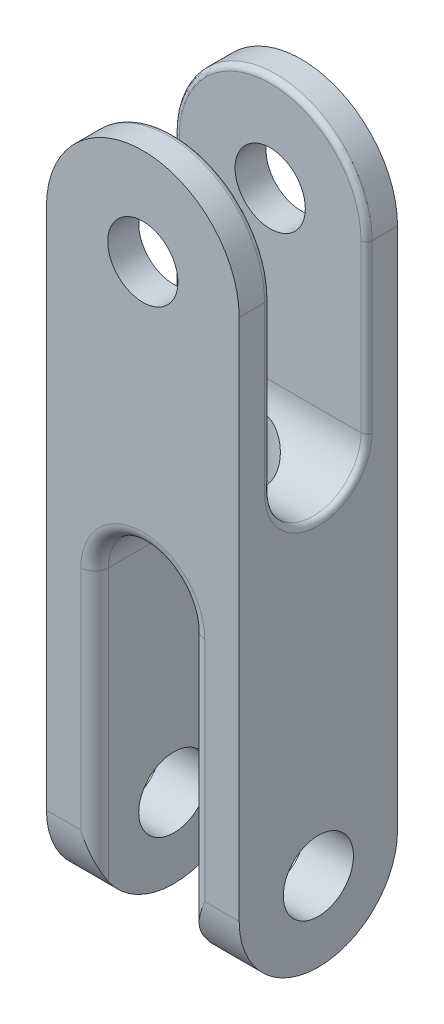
ISO-10303-21;
HEADER;
FILE_DESCRIPTION(('STEP AP214'),'2;1');
FILE_NAME('part.step','',(''),(''),'','','');
FILE_SCHEMA(('AUTOMOTIVE_DESIGN { 1 0 10303 214 1 1 1 1 }'));
ENDSEC;
DATA;
#1=APPLICATION_CONTEXT('core data for automotive mechanical design processes');
#2=APPLICATION_PROTOCOL_DEFINITION('international standard','automotive_design',2000,#1);
#3=PRODUCT_CONTEXT('',#1,'mechanical');
#4=PRODUCT('Part','Part','',(#3));
#5=PRODUCT_RELATED_PRODUCT_CATEGORY('part','',(#4));
#6=PRODUCT_DEFINITION_FORMATION('','',#4);
#7=PRODUCT_DEFINITION_CONTEXT('part definition',#1,'design');
#8=PRODUCT_DEFINITION('design','',#6,#7);
#9=PRODUCT_DEFINITION_SHAPE('','',#8);
#10=(LENGTH_UNIT() NAMED_UNIT(*) SI_UNIT(.MILLI.,.METRE.));
#11=(NAMED_UNIT(*) PLANE_ANGLE_UNIT() SI_UNIT($,.RADIAN.));
#12=(NAMED_UNIT(*) SI_UNIT($,.STERADIAN.) SOLID_ANGLE_UNIT());
#13=UNCERTAINTY_MEASURE_WITH_UNIT(LENGTH_MEASURE(1.E-05),#10,'distance_accuracy_value','');
#14=(GEOMETRIC_REPRESENTATION_CONTEXT(3) GLOBAL_UNCERTAINTY_ASSIGNED_CONTEXT((#13)) GLOBAL_UNIT_ASSIGNED_CONTEXT((#10,
#11,#12)) REPRESENTATION_CONTEXT('',''));
#15=CARTESIAN_POINT('',(0.,0.,0.));
#16=DIRECTION('',(0.,0.,1.));
#17=DIRECTION('',(1.,0.,0.));
#18=AXIS2_PLACEMENT_3D('',#15,#16,#17);
#19=CARTESIAN_POINT('',(35.,-60.4291180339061,0.));
#20=DIRECTION('',(-1.,0.,0.));
#21=DIRECTION('',(0.,-1.,0.));
#22=AXIS2_PLACEMENT_3D('',#19,#20,#21);
#23=CYLINDRICAL_SURFACE('',#22,17.5);
#24=DIRECTION('',(1.,0.,0.));
#25=VECTOR('',#24,1.);
#26=CARTESIAN_POINT('',(35.,-60.4291180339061,17.5));
#27=LINE('',#26,#25);
#28=CARTESIAN_POINT('',(-33.,-60.4291180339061,17.5));
#29=VERTEX_POINT('',#28);
#30=CARTESIAN_POINT('',(33.,-60.4291180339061,17.5));
#31=VERTEX_POINT('',#30);
#32=EDGE_CURVE('E403',#29,#31,#27,.T.);
#33=ORIENTED_EDGE('',*,*,#32,.T.);
#34=CARTESIAN_POINT('',(33.,-60.4291180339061,0.));
#35=DIRECTION('',(-1.,0.,0.));
#36=DIRECTION('',(0.,0.,1.));
#37=AXIS2_PLACEMENT_3D('',#34,#35,#36);
#38=CIRCLE('',#37,17.5);
#39=CARTESIAN_POINT('',(33.,-60.4291180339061,-17.5));
#40=VERTEX_POINT('',#39);
#41=EDGE_CURVE('E329',#40,#31,#38,.T.);
#42=ORIENTED_EDGE('',*,*,#41,.F.);
#43=DIRECTION('',(1.,0.,0.));
#44=VECTOR('',#43,1.);
#45=CARTESIAN_POINT('',(35.,-60.4291180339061,-17.5));
#46=LINE('',#45,#44);
#47=CARTESIAN_POINT('',(-33.,-60.4291180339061,-17.5));
#48=VERTEX_POINT('',#47);
#49=EDGE_CURVE('E390',#40,#48,#46,.F.);
#50=ORIENTED_EDGE('',*,*,#49,.T.);
#51=CARTESIAN_POINT('',(-33.,-60.4291180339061,0.));
#52=DIRECTION('',(1.,0.,0.));
#53=DIRECTION('',(0.,0.,-1.));
#54=AXIS2_PLACEMENT_3D('',#51,#52,#53);
#55=CIRCLE('',#54,17.5);
#56=EDGE_CURVE('E285',#29,#48,#55,.T.);
#57=ORIENTED_EDGE('',*,*,#56,.F.);
#58=EDGE_LOOP('',(#33,#42,#50,#57));
#59=FACE_BOUND('',#58,.T.);
#60=CARTESIAN_POINT('',(0.,-69.4429962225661,15.));
#61=CARTESIAN_POINT('',(-0.251997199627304,-69.4430004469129,14.9999985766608));
#62=CARTESIAN_POINT('',(-0.504018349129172,-69.4536191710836,14.9936320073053));
#63=CARTESIAN_POINT('',(-1.005793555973,-69.495485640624,14.9683517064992));
#64=CARTESIAN_POINT('',(-1.2555463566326,-69.5267441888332,14.9494314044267));
#65=CARTESIAN_POINT('',(-1.75127795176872,-69.6082802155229,14.8995050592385));
#66=CARTESIAN_POINT('',(-1.99724620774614,-69.6586033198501,14.8684700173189));
#67=CARTESIAN_POINT('',(-2.48348616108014,-69.7758800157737,14.7950266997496));
#68=CARTESIAN_POINT('',(-2.72375541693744,-69.8428405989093,14.7526136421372));
#69=CARTESIAN_POINT('',(-3.29690925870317,-70.0216971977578,14.6372114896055));
#70=CARTESIAN_POINT('',(-3.62650267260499,-70.1406741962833,14.5588532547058));
#71=CARTESIAN_POINT('',(-4.27192823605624,-70.3996656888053,14.3827221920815));
#72=CARTESIAN_POINT('',(-4.58775258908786,-70.5396919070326,14.2849385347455));
#73=CARTESIAN_POINT('',(-5.20685162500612,-70.835226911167,14.0711142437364));
#74=CARTESIAN_POINT('',(-5.51008613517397,-70.9907805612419,13.9550201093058));
#75=CARTESIAN_POINT('',(-6.10365926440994,-71.3122470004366,13.7057990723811));
#76=CARTESIAN_POINT('',(-6.39399874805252,-71.4781590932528,13.5726733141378));
#77=CARTESIAN_POINT('',(-7.11080442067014,-71.9048464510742,13.2162762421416));
#78=CARTESIAN_POINT('',(-7.5293315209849,-72.1699861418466,12.9821897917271));
#79=CARTESIAN_POINT('',(-8.33993186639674,-72.7056086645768,12.476924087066));
#80=CARTESIAN_POINT('',(-8.73199200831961,-72.9760940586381,12.2057266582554));
#81=CARTESIAN_POINT('',(-9.48924525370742,-73.5144163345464,11.6267409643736));
#82=CARTESIAN_POINT('',(-9.85446559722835,-73.782255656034,11.3189906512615));
#83=CARTESIAN_POINT('',(-10.5571742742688,-74.3089575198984,10.6665718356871));
#84=CARTESIAN_POINT('',(-10.8946741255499,-74.56782376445,10.321918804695));
#85=CARTESIAN_POINT('',(-11.4677527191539,-75.0145494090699,9.6764208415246));
#86=CARTESIAN_POINT('',(-11.7092921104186,-75.2053846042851,9.38291024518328));
#87=CARTESIAN_POINT('',(-12.1725770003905,-75.5751453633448,8.77353014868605));
#88=CARTESIAN_POINT('',(-12.3943231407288,-75.7540713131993,8.45766137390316));
#89=CARTESIAN_POINT('',(-12.8156944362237,-76.0968249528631,7.80441149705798));
#90=CARTESIAN_POINT('',(-13.0153489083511,-76.2606726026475,7.46705986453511));
#91=CARTESIAN_POINT('',(-13.3904847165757,-76.5704902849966,6.77133718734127));
#92=CARTESIAN_POINT('',(-13.5659707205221,-76.7164637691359,6.41297022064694));
#93=CARTESIAN_POINT('',(-13.8608186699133,-76.9629318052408,5.74336603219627));
#94=CARTESIAN_POINT('',(-13.9845903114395,-77.0668761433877,5.43533500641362));
#95=CARTESIAN_POINT('',(-14.2126798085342,-77.2590464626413,4.8074164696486));
#96=CARTESIAN_POINT('',(-14.3170015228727,-77.347275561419,4.48753132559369));
#97=CARTESIAN_POINT('',(-14.5047343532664,-77.5064375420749,3.8375837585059));
#98=CARTESIAN_POINT('',(-14.5881528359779,-77.5773765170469,3.50752496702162));
#99=CARTESIAN_POINT('',(-14.7328271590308,-77.7006193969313,2.83913810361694));
#100=CARTESIAN_POINT('',(-14.7940827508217,-77.7529230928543,2.50080993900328));
#101=CARTESIAN_POINT('',(-14.8936182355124,-77.8380006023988,1.81664449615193));
#102=CARTESIAN_POINT('',(-14.9317854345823,-77.8706786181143,1.47077878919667));
#103=CARTESIAN_POINT('',(-14.9839708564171,-77.9153755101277,0.775891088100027));
#104=CARTESIAN_POINT('',(-14.9979890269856,-77.9273943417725,0.426869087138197));
#105=CARTESIAN_POINT('',(-15.0016079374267,-77.9304962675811,-0.271363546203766));
#106=CARTESIAN_POINT('',(-14.9912107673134,-77.921581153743,-0.620574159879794));
#107=CARTESIAN_POINT('',(-14.9462017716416,-77.8830233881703,-1.31626100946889));
#108=CARTESIAN_POINT('',(-14.9115910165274,-77.8533816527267,-1.66273736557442));
#109=CARTESIAN_POINT('',(-14.8223936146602,-77.7771111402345,-2.3235979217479));
#110=CARTESIAN_POINT('',(-14.7695562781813,-77.7319711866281,-2.63839393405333));
#111=CARTESIAN_POINT('',(-14.644615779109,-77.6254462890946,-3.26130793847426));
#112=CARTESIAN_POINT('',(-14.572513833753,-77.5640623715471,-3.56942635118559));
#113=CARTESIAN_POINT('',(-14.4100317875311,-77.4260935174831,-4.17731808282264));
#114=CARTESIAN_POINT('',(-14.3196507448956,-77.3495077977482,-4.47709097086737));
#115=CARTESIAN_POINT('',(-14.1217311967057,-77.1823411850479,-5.0669015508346));
#116=CARTESIAN_POINT('',(-14.0141916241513,-77.0917594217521,-5.35693863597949));
#117=CARTESIAN_POINT('',(-13.7743302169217,-76.8905150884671,-5.94786570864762));
#118=CARTESIAN_POINT('',(-13.6407447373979,-76.7788485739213,-6.24789995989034));
#119=CARTESIAN_POINT('',(-13.3565309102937,-76.542487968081,-6.83442046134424));
#120=CARTESIAN_POINT('',(-13.2059021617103,-76.4177935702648,-7.12090639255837));
#121=CARTESIAN_POINT('',(-12.8889064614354,-76.1569845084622,-7.67980179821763));
#122=CARTESIAN_POINT('',(-12.7225319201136,-76.0208643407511,-7.95220438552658));
#123=CARTESIAN_POINT('',(-12.3753480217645,-75.7388858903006,-8.48240611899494));
#124=CARTESIAN_POINT('',(-12.1945357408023,-75.5930256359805,-8.74020228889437));
#125=CARTESIAN_POINT('',(-11.7252688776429,-75.2177359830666,-9.36691525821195));
#126=CARTESIAN_POINT('',(-11.4284110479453,-74.9831698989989,-9.72651356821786));
#127=CARTESIAN_POINT('',(-10.8075670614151,-74.5009062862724,-10.4120384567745));
#128=CARTESIAN_POINT('',(-10.4835683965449,-74.2532027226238,-10.737949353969));
#129=CARTESIAN_POINT('',(-9.80982374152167,-73.7494943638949,-11.3568065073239));
#130=CARTESIAN_POINT('',(-9.46002368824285,-73.493472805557,-11.6496800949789));
#131=CARTESIAN_POINT('',(-8.73639006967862,-72.9793972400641,-12.2017459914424));
#132=CARTESIAN_POINT('',(-8.3625638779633,-72.721343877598,-12.460948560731));
#133=CARTESIAN_POINT('',(-7.67095790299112,-72.2630223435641,-12.895217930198));
#134=CARTESIAN_POINT('',(-7.35768009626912,-72.0618925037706,-13.0765740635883));
#135=CARTESIAN_POINT('',(-6.71526612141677,-71.6665821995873,-13.4178061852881));
#136=CARTESIAN_POINT('',(-6.38612741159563,-71.4724028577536,-13.57767871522));
#137=CARTESIAN_POINT('',(-5.71197697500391,-71.0967551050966,-13.874750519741));
#138=CARTESIAN_POINT('',(-5.36700726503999,-70.9152559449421,-14.012005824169));
#139=CARTESIAN_POINT('',(-4.65943538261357,-70.5713477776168,-14.2629026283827));
#140=CARTESIAN_POINT('',(-4.29684507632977,-70.408926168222,-14.3765597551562));
#141=CARTESIAN_POINT('',(-3.70247112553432,-70.171638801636,-14.5377067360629));
#142=CARTESIAN_POINT('',(-3.47650377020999,-70.0877713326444,-14.5934589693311));
#143=CARTESIAN_POINT('',(-3.0180918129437,-69.9324002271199,-14.6951092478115));
#144=CARTESIAN_POINT('',(-2.7856463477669,-69.860898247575,-14.7410059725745));
#145=CARTESIAN_POINT('',(-2.3153300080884,-69.732864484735,-14.822147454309));
#146=CARTESIAN_POINT('',(-2.07747140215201,-69.6763019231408,-14.8574141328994));
#147=CARTESIAN_POINT('',(-1.59701647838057,-69.5803542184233,-14.916704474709));
#148=CARTESIAN_POINT('',(-1.35442274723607,-69.540959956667,-14.9407341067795));
#149=CARTESIAN_POINT('',(-0.863318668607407,-69.4809313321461,-14.9771807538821));
#150=CARTESIAN_POINT('',(-0.614772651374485,-69.4605061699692,-14.9894683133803));
#151=CARTESIAN_POINT('',(-0.116541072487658,-69.4403134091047,-15.0016166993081));
#152=CARTESIAN_POINT('',(0.133144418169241,-69.4405445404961,-15.0014782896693));
#153=CARTESIAN_POINT('',(0.631489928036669,-69.461656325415,-14.988775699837));
#154=CARTESIAN_POINT('',(0.880149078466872,-69.4825518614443,-14.9762025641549));
#155=CARTESIAN_POINT('',(1.37412746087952,-69.543836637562,-14.9389814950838));
#156=CARTESIAN_POINT('',(1.61944613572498,-69.5842290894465,-14.9143315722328));
#157=CARTESIAN_POINT('',(2.14878403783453,-69.6913283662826,-14.8481007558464));
#158=CARTESIAN_POINT('',(2.43182446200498,-69.761462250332,-14.8042715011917));
#159=CARTESIAN_POINT('',(2.98946214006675,-69.9220320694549,-14.701823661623));
#160=CARTESIAN_POINT('',(3.26405227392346,-70.0124846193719,-14.6431929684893));
#161=CARTESIAN_POINT('',(3.80472867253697,-70.2098332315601,-14.5121210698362));
#162=CARTESIAN_POINT('',(4.07078814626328,-70.3167759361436,-14.4396405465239));
#163=CARTESIAN_POINT('',(4.59347117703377,-70.5431947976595,-14.2819647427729));
#164=CARTESIAN_POINT('',(4.85009693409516,-70.6626680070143,-14.1967724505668));
#165=CARTESIAN_POINT('',(5.5244374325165,-70.9948159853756,-13.9528613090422));
#166=CARTESIAN_POINT('',(5.9340634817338,-71.2160040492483,-13.7833050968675));
#167=CARTESIAN_POINT('',(6.72999911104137,-71.6735388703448,-13.4126784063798));
#168=CARTESIAN_POINT('',(7.11629354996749,-71.909895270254,-13.2115877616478));
#169=CARTESIAN_POINT('',(7.86730915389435,-72.3899352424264,-12.7786344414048));
#170=CARTESIAN_POINT('',(8.23200029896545,-72.63362833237,-12.5467303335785));
#171=CARTESIAN_POINT('',(8.93965343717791,-73.121709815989,-12.0527474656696));
#172=CARTESIAN_POINT('',(9.28262040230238,-73.3660980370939,-11.7906756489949));
#173=CARTESIAN_POINT('',(9.96342556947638,-73.8627685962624,-11.2221511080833));
#174=CARTESIAN_POINT('',(10.3001175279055,-74.1148210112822,-10.9141198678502));
#175=CARTESIAN_POINT('',(10.9477688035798,-74.608674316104,-10.2643438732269));
#176=CARTESIAN_POINT('',(11.2587231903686,-74.8504732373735,-9.92259268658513));
#177=CARTESIAN_POINT('',(11.8515992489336,-75.3179488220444,-9.20625981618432));
#178=CARTESIAN_POINT('',(12.1335896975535,-75.5436632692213,-8.83176000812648));
#179=CARTESIAN_POINT('',(12.6658887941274,-75.974222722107,-8.04976441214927));
#180=CARTESIAN_POINT('',(12.9162128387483,-76.1790778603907,-7.64228481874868));
#181=CARTESIAN_POINT('',(13.3105412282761,-76.5043213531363,-6.92407186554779));
#182=CARTESIAN_POINT('',(13.4637769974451,-76.6314943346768,-6.62143947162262));
#183=CARTESIAN_POINT('',(13.7512259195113,-76.8711345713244,-6.00169865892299));
#184=CARTESIAN_POINT('',(13.8854440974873,-76.9836057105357,-5.68459409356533));
#185=CARTESIAN_POINT('',(14.1331623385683,-77.1919277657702,-5.0372384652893));
#186=CARTESIAN_POINT('',(14.2466710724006,-77.287785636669,-4.70699297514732));
#187=CARTESIAN_POINT('',(14.4513943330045,-77.4611417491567,-4.03491997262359));
#188=CARTESIAN_POINT('',(14.542608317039,-77.5386395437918,-3.69309217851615));
#189=CARTESIAN_POINT('',(14.7017815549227,-77.6741353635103,-2.99762280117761));
#190=CARTESIAN_POINT('',(14.7695731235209,-77.7319927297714,-2.64391514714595));
#191=CARTESIAN_POINT('',(14.879743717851,-77.8261279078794,-1.92970604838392));
#192=CARTESIAN_POINT('',(14.9221227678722,-77.8624057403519,-1.56920461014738));
#193=CARTESIAN_POINT('',(14.980607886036,-77.9124925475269,-0.844651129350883));
#194=CARTESIAN_POINT('',(14.9967237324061,-77.9263098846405,-0.480600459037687));
#195=CARTESIAN_POINT('',(15.0023733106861,-77.9311522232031,0.247841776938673));
#196=CARTESIAN_POINT('',(14.9919093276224,-77.9221791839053,0.612233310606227));
#197=CARTESIAN_POINT('',(14.9471526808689,-77.8838383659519,1.29932460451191));
#198=CARTESIAN_POINT('',(14.9155170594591,-77.8567449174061,1.62233068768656));
#199=CARTESIAN_POINT('',(14.8317337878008,-77.7850926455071,2.26367845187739));
#200=CARTESIAN_POINT('',(14.779587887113,-77.7405353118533,2.58202052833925));
#201=CARTESIAN_POINT('',(14.6555766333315,-77.6347821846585,3.21203588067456));
#202=CARTESIAN_POINT('',(14.583709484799,-77.573584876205,3.52370854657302));
#203=CARTESIAN_POINT('',(14.4212707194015,-77.4356230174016,4.13860985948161));
#204=CARTESIAN_POINT('',(14.3306980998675,-77.3588576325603,4.44183805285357));
#205=CARTESIAN_POINT('',(14.1289773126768,-77.1884437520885,5.04747000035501));
#206=CARTESIAN_POINT('',(14.0172869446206,-77.0943526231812,5.3495679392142));
#207=CARTESIAN_POINT('',(13.7766034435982,-76.8924261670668,5.94200666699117));
#208=CARTESIAN_POINT('',(13.6476104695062,-76.7845909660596,6.23234756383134));
#209=CARTESIAN_POINT('',(13.3736249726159,-76.5566739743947,6.80041251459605));
#210=CARTESIAN_POINT('',(13.2286307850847,-76.4365909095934,7.07813525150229));
#211=CARTESIAN_POINT('',(12.9238937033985,-76.1856898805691,7.62034980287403));
#212=CARTESIAN_POINT('',(12.7641477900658,-76.0548697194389,7.88483889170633));
#213=CARTESIAN_POINT('',(12.3514037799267,-75.7191995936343,8.52340837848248));
#214=CARTESIAN_POINT('',(12.090336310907,-75.5088586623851,8.88942795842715));
#215=CARTESIAN_POINT('',(11.5416431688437,-75.0726082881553,9.59109005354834));
#216=CARTESIAN_POINT('',(11.2540065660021,-74.8466924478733,9.92671995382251));
#217=CARTESIAN_POINT('',(10.6536902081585,-74.3831346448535,10.5684703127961));
#218=CARTESIAN_POINT('',(10.3409330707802,-74.1454573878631,10.8744926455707));
#219=CARTESIAN_POINT('',(9.69287832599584,-73.6637266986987,11.4558992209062));
#220=CARTESIAN_POINT('',(9.35758450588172,-73.4196743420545,11.7312885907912));
#221=CARTESIAN_POINT('',(8.65824864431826,-72.9252291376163,12.256829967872));
#222=CARTESIAN_POINT('',(8.29376657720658,-72.6748069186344,12.5063690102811));
#223=CARTESIAN_POINT('',(7.5417653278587,-72.1785134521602,12.9737394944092));
#224=CARTESIAN_POINT('',(7.15423563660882,-71.9326443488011,13.1915563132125));
#225=CARTESIAN_POINT('',(6.35621025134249,-71.4540658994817,13.5940340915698));
#226=CARTESIAN_POINT('',(5.94578687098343,-71.2213193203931,13.7787924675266));
#227=CARTESIAN_POINT('',(5.311088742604,-70.889778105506,14.0301075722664));
#228=CARTESIAN_POINT('',(5.09644373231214,-70.7822374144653,14.10954637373));
#229=CARTESIAN_POINT('',(4.66049167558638,-70.5747251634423,14.2594897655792));
#230=CARTESIAN_POINT('',(4.43918370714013,-70.4747546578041,14.3299931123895));
#231=CARTESIAN_POINT('',(3.75092951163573,-70.1832631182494,14.5314600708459));
#232=CARTESIAN_POINT('',(3.27237495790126,-70.0070827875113,14.6472515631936));
#233=CARTESIAN_POINT('',(2.53530470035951,-69.7898298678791,14.7862962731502));
#234=CARTESIAN_POINT('',(2.28679479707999,-69.7253101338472,14.8268358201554));
#235=CARTESIAN_POINT('',(1.78409721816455,-69.6145969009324,14.8956781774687));
#236=CARTESIAN_POINT('',(1.52991313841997,-69.568392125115,14.9239885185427));
#237=CARTESIAN_POINT('',(1.06332881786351,-69.5031045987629,14.963754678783));
#238=CARTESIAN_POINT('',(0.851576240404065,-69.4806511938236,14.9773179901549));
#239=CARTESIAN_POINT('',(0.426555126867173,-69.4505929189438,14.995442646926));
#240=CARTESIAN_POINT('',(0.213286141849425,-69.4429926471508,15.0000012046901));
#241=CARTESIAN_POINT('',(0.,-69.4429962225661,15.));
#242=B_SPLINE_CURVE_WITH_KNOTS('',3,(#60,#61,#62,#63,#64,#65,#66,#67,#68,#69,#70,#71,#72,#73,
#74,#75,#76,#77,#78,#79,#80,#81,#82,#83,#84,#85,#86,#87,#88,#89,#90,#91,#92,#93,#94,#95,#96,#97,
#98,#99,#100,#101,#102,#103,#104,#105,#106,#107,#108,#109,#110,#111,#112,#113,#114,#115,#116,
#117,#118,#119,#120,#121,#122,#123,#124,#125,#126,#127,#128,#129,#130,#131,#132,#133,#134,#135,
#136,#137,#138,#139,#140,#141,#142,#143,#144,#145,#146,#147,#148,#149,#150,#151,#152,#153,#154,
#155,#156,#157,#158,#159,#160,#161,#162,#163,#164,#165,#166,#167,#168,#169,#170,#171,#172,#173,
#174,#175,#176,#177,#178,#179,#180,#181,#182,#183,#184,#185,#186,#187,#188,#189,#190,#191,#192,
#193,#194,#195,#196,#197,#198,#199,#200,#201,#202,#203,#204,#205,#206,#207,#208,#209,#210,#211,
#212,#213,#214,#215,#216,#217,#218,#219,#220,#221,#222,#223,#224,#225,#226,#227,#228,#229,#230,
#231,#232,#233,#234,#235,#236,#237,#238,#239,#240,#241),.UNSPECIFIED.,.T.,.F.,(4,2,2,2,2,2,2,2,
2,2,2,2,2,2,2,2,2,2,2,2,2,2,2,2,2,2,2,2,2,2,2,2,2,2,2,2,2,2,2,2,2,2,2,2,2,2,2,2,2,2,2,2,2,2,2,2,
2,2,2,2,2,2,2,2,2,2,2,2,2,2,2,2,2,2,2,2,2,2,2,2,2,2,2,2,2,2,2,2,2,2,4),(0.,0.755738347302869,
1.51187256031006,2.26982792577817,3.02810234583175,4.10350052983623,5.17949993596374,
6.25870358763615,7.33783477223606,8.9795242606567,10.622020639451,12.2628263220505,
13.9029467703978,15.1778537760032,16.4527194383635,17.7258724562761,18.9987792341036,
20.0413481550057,21.0837100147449,22.1257040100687,23.1677096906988,24.2147611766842,
25.2618149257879,26.3087790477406,27.3556968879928,28.3217555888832,29.2877532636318,
30.2538007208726,31.2199082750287,32.2595939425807,33.2993040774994,34.3395179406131,
35.3799430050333,36.9436135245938,38.5080086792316,40.0757803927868,41.6430732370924,
42.8845833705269,44.126293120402,45.3648789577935,46.6026419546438,47.3443338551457,
48.0861250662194,48.8263758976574,49.5662330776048,50.3141561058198,51.0620331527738,
51.8104492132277,52.5589886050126,53.442213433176,54.3261631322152,55.2126605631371,
56.0989499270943,57.5829996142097,59.0680022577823,60.5550222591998,62.0417006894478,
63.6039257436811,65.1664493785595,66.7251724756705,68.2831347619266,69.3689848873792,
70.4545475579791,71.5396546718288,72.6247881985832,73.7175367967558,74.8102843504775,
75.9026249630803,76.9948716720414,77.9707688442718,78.9465827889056,79.9224856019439,
80.8984407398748,81.9040912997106,82.9097326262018,83.9154786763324,84.9214310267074,
86.4083264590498,87.8958363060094,89.3881183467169,90.8801502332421,92.4019429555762,
93.9244349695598,95.4423638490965,96.2006641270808,96.9590698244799,98.5217470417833,
99.3007552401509,100.079283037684,100.718729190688,101.358373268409),.UNSPECIFIED.);
#243=CARTESIAN_POINT('',(0.,-69.4429962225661,15.));
#244=VERTEX_POINT('',#243);
#245=EDGE_CURVE('E405',#244,#244,#242,.T.);
#246=ORIENTED_EDGE('',*,*,#245,.T.);
#247=EDGE_LOOP('',(#246));
#248=FACE_BOUND('',#247,.T.);
#249=ADVANCED_FACE('F16',(#59,#248),#23,.F.);
#250=CARTESIAN_POINT('',(35.,39.5708819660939,-17.5));
#251=DIRECTION('',(0.,0.,-1.));
#252=DIRECTION('',(0.,1.,0.));
#253=AXIS2_PLACEMENT_3D('',#250,#251,#252);
#254=PLANE('',#253);
#255=CARTESIAN_POINT('',(0.,0.,-17.5));
#256=DIRECTION('',(0.,0.,1.));
#257=DIRECTION('',(1.,0.,0.));
#258=AXIS2_PLACEMENT_3D('',#255,#256,#257);
#259=CIRCLE('',#258,12.75);
#260=CARTESIAN_POINT('',(12.75,0.,-17.5));
#261=VERTEX_POINT('',#260);
#262=EDGE_CURVE('E20',#261,#261,#259,.F.);
#263=ORIENTED_EDGE('',*,*,#262,.T.);
#264=EDGE_LOOP('',(#263));
#265=FACE_BOUND('',#264,.T.);
#266=ORIENTED_EDGE('',*,*,#49,.F.);
#267=DIRECTION('',(0.,-1.,0.));
#268=VECTOR('',#267,1.);
#269=CARTESIAN_POINT('',(33.,-90.2145590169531,-17.5));
#270=LINE('',#269,#268);
#271=CARTESIAN_POINT('',(33.,0.,-17.5));
#272=VERTEX_POINT('',#271);
#273=EDGE_CURVE('E335',#272,#40,#270,.T.);
#274=ORIENTED_EDGE('',*,*,#273,.F.);
#275=CARTESIAN_POINT('',(0.,0.,-17.5));
#276=DIRECTION('',(0.,0.,-1.));
#277=DIRECTION('',(-1.,0.,0.));
#278=AXIS2_PLACEMENT_3D('',#275,#276,#277);
#279=CIRCLE('',#278,33.);
#280=CARTESIAN_POINT('',(-33.,0.,-17.5));
#281=VERTEX_POINT('',#280);
#282=EDGE_CURVE('E344',#281,#272,#279,.T.);
#283=ORIENTED_EDGE('',*,*,#282,.F.);
#284=DIRECTION('',(0.,1.,0.));
#285=VECTOR('',#284,1.);
#286=CARTESIAN_POINT('',(-33.,19.7854409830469,-17.5));
#287=LINE('',#286,#285);
#288=EDGE_CURVE('E379',#48,#281,#287,.T.);
#289=ORIENTED_EDGE('',*,*,#288,.F.);
#290=EDGE_LOOP('',(#266,#274,#283,#289));
#291=FACE_BOUND('',#290,.T.);
#292=ADVANCED_FACE('F363',(#265,#291),#254,.F.);
#293=CARTESIAN_POINT('',(0.,0.,-19.5));
#294=DIRECTION('',(0.,0.,-1.));
#295=DIRECTION('',(-1.,0.,0.));
#296=AXIS2_PLACEMENT_3D('',#293,#294,#295);
#297=TOROIDAL_SURFACE('',#296,33.,2.);
#298=CARTESIAN_POINT('',(-33.,0.,-19.5));
#299=DIRECTION('',(0.,1.,0.));
#300=DIRECTION('',(0.,0.,1.));
#301=AXIS2_PLACEMENT_3D('',#298,#299,#300);
#302=CIRCLE('',#301,2.);
#303=CARTESIAN_POINT('',(-35.,0.,-19.5));
#304=VERTEX_POINT('',#303);
#305=EDGE_CURVE('E396',#281,#304,#302,.F.);
#306=ORIENTED_EDGE('',*,*,#305,.F.);
#307=ORIENTED_EDGE('',*,*,#282,.T.);
#308=CARTESIAN_POINT('',(33.,0.,-19.5));
#309=DIRECTION('',(0.,-1.,0.));
#310=DIRECTION('',(0.,0.,-1.));
#311=AXIS2_PLACEMENT_3D('',#308,#309,#310);
#312=CIRCLE('',#311,2.);
#313=CARTESIAN_POINT('',(35.,0.,-19.5));
#314=VERTEX_POINT('',#313);
#315=EDGE_CURVE('E338',#314,#272,#312,.T.);
#316=ORIENTED_EDGE('',*,*,#315,.F.);
#317=CARTESIAN_POINT('',(0.,0.,-19.5));
#318=DIRECTION('',(0.,0.,1.));
#319=DIRECTION('',(1.,0.,0.));
#320=AXIS2_PLACEMENT_3D('',#317,#318,#319);
#321=CIRCLE('',#320,35.);
#322=EDGE_CURVE('E174',#304,#314,#321,.F.);
#323=ORIENTED_EDGE('',*,*,#322,.F.);
#324=EDGE_LOOP('',(#306,#307,#316,#323));
#325=FACE_BOUND('',#324,.T.);
#326=ADVANCED_FACE('F352',(#325),#297,.T.);
#327=CARTESIAN_POINT('',(0.,0.,0.));
#328=DIRECTION('',(0.,0.,1.));
#329=DIRECTION('',(1.,0.,0.));
#330=AXIS2_PLACEMENT_3D('',#327,#328,#329);
#331=CYLINDRICAL_SURFACE('',#330,12.75);
#332=ORIENTED_EDGE('',*,*,#262,.F.);
#333=EDGE_LOOP('',(#332));
#334=FACE_BOUND('',#333,.T.);
#335=CARTESIAN_POINT('',(0.,0.,-28.75));
#336=DIRECTION('',(0.,0.,1.));
#337=DIRECTION('',(1.,0.,0.));
#338=AXIS2_PLACEMENT_3D('',#335,#336,#337);
#339=CIRCLE('',#338,12.75);
#340=CARTESIAN_POINT('',(12.75,0.,-28.75));
#341=VERTEX_POINT('',#340);
#342=EDGE_CURVE('E168',#341,#341,#339,.F.);
#343=ORIENTED_EDGE('',*,*,#342,.T.);
#344=EDGE_LOOP('',(#343));
#345=FACE_BOUND('',#344,.T.);
#346=ADVANCED_FACE('F362',(#334,#345),#331,.F.);
#347=CARTESIAN_POINT('',(0.,0.,0.));
#348=DIRECTION('',(0.,-1.,0.));
#349=DIRECTION('',(0.,0.,-1.));
#350=AXIS2_PLACEMENT_3D('',#347,#348,#349);
#351=CYLINDRICAL_SURFACE('',#350,15.);
#352=CARTESIAN_POINT('',(15.,-98.48612181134,0.));
#353=CARTESIAN_POINT('',(14.9999985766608,-98.4861175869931,0.251997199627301));
#354=CARTESIAN_POINT('',(14.9936320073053,-98.4754988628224,0.504018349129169));
#355=CARTESIAN_POINT('',(14.9683517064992,-98.4336323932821,1.005793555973));
#356=CARTESIAN_POINT('',(14.9494314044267,-98.4023738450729,1.2555463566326));
#357=CARTESIAN_POINT('',(14.8995050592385,-98.3208378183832,1.75127795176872));
#358=CARTESIAN_POINT('',(14.8684700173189,-98.270514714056,1.99724620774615));
#359=CARTESIAN_POINT('',(14.7950266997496,-98.1532380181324,2.48348616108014));
#360=CARTESIAN_POINT('',(14.7526136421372,-98.0862774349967,2.72375541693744));
#361=CARTESIAN_POINT('',(14.6372114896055,-97.9074208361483,3.29690925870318));
#362=CARTESIAN_POINT('',(14.5588532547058,-97.7884438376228,3.62650267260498));
#363=CARTESIAN_POINT('',(14.3827221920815,-97.5294523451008,4.27192823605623));
#364=CARTESIAN_POINT('',(14.2849385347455,-97.3894261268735,4.58775258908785));
#365=CARTESIAN_POINT('',(14.0711142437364,-97.0938911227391,5.20685162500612));
#366=CARTESIAN_POINT('',(13.9550201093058,-96.9383374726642,5.51008613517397));
#367=CARTESIAN_POINT('',(13.7057990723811,-96.6168710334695,6.10365926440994));
#368=CARTESIAN_POINT('',(13.5726733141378,-96.4509589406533,6.39399874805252));
#369=CARTESIAN_POINT('',(13.2162762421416,-96.0242715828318,7.11080442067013));
#370=CARTESIAN_POINT('',(12.9821897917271,-95.7591318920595,7.52933152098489));
#371=CARTESIAN_POINT('',(12.476924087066,-95.2235093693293,8.33993186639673));
#372=CARTESIAN_POINT('',(12.2057266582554,-94.953023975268,8.7319920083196));
#373=CARTESIAN_POINT('',(11.6267409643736,-94.4147016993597,9.48924525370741));
#374=CARTESIAN_POINT('',(11.3189906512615,-94.1468623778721,9.85446559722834));
#375=CARTESIAN_POINT('',(10.6665718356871,-93.6201605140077,10.5571742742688));
#376=CARTESIAN_POINT('',(10.321918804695,-93.3612942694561,10.8946741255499));
#377=CARTESIAN_POINT('',(9.67642084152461,-92.9145686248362,11.4677527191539));
#378=CARTESIAN_POINT('',(9.38291024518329,-92.7237334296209,11.7092921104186));
#379=CARTESIAN_POINT('',(8.77353014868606,-92.3539726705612,12.1725770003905));
#380=CARTESIAN_POINT('',(8.45766137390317,-92.1750467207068,12.3943231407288));
#381=CARTESIAN_POINT('',(7.80441149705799,-91.832293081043,12.8156944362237));
#382=CARTESIAN_POINT('',(7.46705986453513,-91.6684454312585,13.0153489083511));
#383=CARTESIAN_POINT('',(6.77133718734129,-91.3586277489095,13.3904847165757));
#384=CARTESIAN_POINT('',(6.41297022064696,-91.2126542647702,13.5659707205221));
#385=CARTESIAN_POINT('',(5.74336603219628,-90.9661862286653,13.8608186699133));
#386=CARTESIAN_POINT('',(5.43533500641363,-90.8622418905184,13.9845903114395));
#387=CARTESIAN_POINT('',(4.80741646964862,-90.6700715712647,14.2126798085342));
#388=CARTESIAN_POINT('',(4.4875313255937,-90.5818424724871,14.3170015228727));
#389=CARTESIAN_POINT('',(3.83758375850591,-90.4226804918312,14.5047343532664));
#390=CARTESIAN_POINT('',(3.50752496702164,-90.3517415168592,14.5881528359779));
#391=CARTESIAN_POINT('',(2.83913810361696,-90.2284986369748,14.7328271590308));
#392=CARTESIAN_POINT('',(2.50080993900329,-90.1761949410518,14.7940827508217));
#393=CARTESIAN_POINT('',(1.81664449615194,-90.0911174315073,14.8936182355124));
#394=CARTESIAN_POINT('',(1.47077878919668,-90.0584394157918,14.9317854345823));
#395=CARTESIAN_POINT('',(0.775891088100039,-90.0137425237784,14.9839708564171));
#396=CARTESIAN_POINT('',(0.426869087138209,-90.0017236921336,14.9979890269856));
#397=CARTESIAN_POINT('',(-0.271363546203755,-89.998621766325,15.0016079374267));
#398=CARTESIAN_POINT('',(-0.620574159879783,-90.0075368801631,14.9912107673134));
#399=CARTESIAN_POINT('',(-1.31626100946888,-90.0460946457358,14.9462017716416));
#400=CARTESIAN_POINT('',(-1.6627373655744,-90.0757363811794,14.9115910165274));
#401=CARTESIAN_POINT('',(-2.32359792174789,-90.1520068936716,14.8223936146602));
#402=CARTESIAN_POINT('',(-2.63839393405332,-90.1971468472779,14.7695562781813));
#403=CARTESIAN_POINT('',(-3.26130793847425,-90.3036717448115,14.644615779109));
#404=CARTESIAN_POINT('',(-3.56942635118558,-90.365055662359,14.572513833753));
#405=CARTESIAN_POINT('',(-4.17731808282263,-90.503024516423,14.4100317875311));
#406=CARTESIAN_POINT('',(-4.47709097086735,-90.5796102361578,14.3196507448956));
#407=CARTESIAN_POINT('',(-5.06690155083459,-90.7467768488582,14.1217311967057));
#408=CARTESIAN_POINT('',(-5.35693863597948,-90.837358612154,14.0141916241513));
#409=CARTESIAN_POINT('',(-5.94786570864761,-91.038602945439,13.7743302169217));
#410=CARTESIAN_POINT('',(-6.24789995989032,-91.1502694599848,13.6407447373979));
#411=CARTESIAN_POINT('',(-6.83442046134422,-91.3866300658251,13.3565309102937));
#412=CARTESIAN_POINT('',(-7.12090639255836,-91.5113244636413,13.2059021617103));
#413=CARTESIAN_POINT('',(-7.67980179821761,-91.7721335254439,12.8889064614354));
#414=CARTESIAN_POINT('',(-7.95220438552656,-91.908253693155,12.7225319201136));
#415=CARTESIAN_POINT('',(-8.48240611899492,-92.1902321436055,12.3753480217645));
#416=CARTESIAN_POINT('',(-8.74020228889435,-92.3360923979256,12.1945357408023));
#417=CARTESIAN_POINT('',(-9.36691525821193,-92.7113820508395,11.725268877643));
#418=CARTESIAN_POINT('',(-9.72651356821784,-92.9459481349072,11.4284110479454));
#419=CARTESIAN_POINT('',(-10.4120384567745,-93.4282117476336,10.8075670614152));
#420=CARTESIAN_POINT('',(-10.737949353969,-93.6759153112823,10.4835683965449));
#421=CARTESIAN_POINT('',(-11.3568065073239,-94.1796236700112,9.80982374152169));
#422=CARTESIAN_POINT('',(-11.6496800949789,-94.4356452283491,9.46002368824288));
#423=CARTESIAN_POINT('',(-12.2017459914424,-94.949720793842,8.73639006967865));
#424=CARTESIAN_POINT('',(-12.460948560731,-95.2077741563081,8.36256387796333));
#425=CARTESIAN_POINT('',(-12.895217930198,-95.666095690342,7.67095790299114));
#426=CARTESIAN_POINT('',(-13.0765740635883,-95.8672255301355,7.35768009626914));
#427=CARTESIAN_POINT('',(-13.4178061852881,-96.2625358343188,6.71526612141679));
#428=CARTESIAN_POINT('',(-13.57767871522,-96.4567151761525,6.38612741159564));
#429=CARTESIAN_POINT('',(-13.874750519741,-96.8323629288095,5.71197697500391));
#430=CARTESIAN_POINT('',(-14.012005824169,-97.013862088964,5.36700726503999));
#431=CARTESIAN_POINT('',(-14.2629026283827,-97.3577702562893,4.65943538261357));
#432=CARTESIAN_POINT('',(-14.3765597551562,-97.5201918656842,4.29684507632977));
#433=CARTESIAN_POINT('',(-14.5377067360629,-97.7574792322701,3.70247112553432));
#434=CARTESIAN_POINT('',(-14.5934589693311,-97.8413467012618,3.47650377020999));
#435=CARTESIAN_POINT('',(-14.6951092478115,-97.9967178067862,3.01809181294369));
#436=CARTESIAN_POINT('',(-14.7410059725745,-98.0682197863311,2.7856463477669));
#437=CARTESIAN_POINT('',(-14.822147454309,-98.1962535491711,2.31533000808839));
#438=CARTESIAN_POINT('',(-14.8574141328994,-98.2528161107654,2.07747140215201));
#439=CARTESIAN_POINT('',(-14.916704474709,-98.3487638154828,1.59701647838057));
#440=CARTESIAN_POINT('',(-14.9407341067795,-98.3881580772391,1.35442274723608));
#441=CARTESIAN_POINT('',(-14.9771807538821,-98.4481867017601,0.86331866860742));
#442=CARTESIAN_POINT('',(-14.9894683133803,-98.4686118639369,0.614772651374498));
#443=CARTESIAN_POINT('',(-15.0016166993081,-98.4888046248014,0.116541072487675));
#444=CARTESIAN_POINT('',(-15.0014782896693,-98.48857349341,-0.133144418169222));
#445=CARTESIAN_POINT('',(-14.988775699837,-98.4674617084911,-0.631489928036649));
#446=CARTESIAN_POINT('',(-14.9762025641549,-98.4465661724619,-0.880149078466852));
#447=CARTESIAN_POINT('',(-14.9389814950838,-98.3852813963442,-1.37412746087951));
#448=CARTESIAN_POINT('',(-14.9143315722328,-98.3448889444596,-1.61944613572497));
#449=CARTESIAN_POINT('',(-14.8481007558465,-98.2377896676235,-2.14878403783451));
#450=CARTESIAN_POINT('',(-14.8042715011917,-98.1676557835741,-2.43182446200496));
#451=CARTESIAN_POINT('',(-14.701823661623,-98.0070859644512,-2.98946214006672));
#452=CARTESIAN_POINT('',(-14.6431929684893,-97.9166334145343,-3.26405227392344));
#453=CARTESIAN_POINT('',(-14.5121210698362,-97.719284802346,-3.80472867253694));
#454=CARTESIAN_POINT('',(-14.4396405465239,-97.6123420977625,-4.07078814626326));
#455=CARTESIAN_POINT('',(-14.2819647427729,-97.3859232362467,-4.59347117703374));
#456=CARTESIAN_POINT('',(-14.1967724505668,-97.2664500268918,-4.85009693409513));
#457=CARTESIAN_POINT('',(-13.9528613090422,-96.9343020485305,-5.52443743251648));
#458=CARTESIAN_POINT('',(-13.7833050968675,-96.7131139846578,-5.93406348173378));
#459=CARTESIAN_POINT('',(-13.4126784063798,-96.2555791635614,-6.72999911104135));
#460=CARTESIAN_POINT('',(-13.2115877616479,-96.0192227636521,-7.11629354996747));
#461=CARTESIAN_POINT('',(-12.7786344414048,-95.5391827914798,-7.86730915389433));
#462=CARTESIAN_POINT('',(-12.5467303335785,-95.2954897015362,-8.23200029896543));
#463=CARTESIAN_POINT('',(-12.0527474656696,-94.8074082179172,-8.93965343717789));
#464=CARTESIAN_POINT('',(-11.790675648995,-94.5630199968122,-9.28262040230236));
#465=CARTESIAN_POINT('',(-11.2221511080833,-94.0663494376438,-9.96342556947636));
#466=CARTESIAN_POINT('',(-10.9141198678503,-93.814297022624,-10.3001175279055));
#467=CARTESIAN_POINT('',(-10.264343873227,-93.3204437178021,-10.9477688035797));
#468=CARTESIAN_POINT('',(-9.92259268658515,-93.0786447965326,-11.2587231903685));
#469=CARTESIAN_POINT('',(-9.20625981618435,-92.6111692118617,-11.8515992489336));
#470=CARTESIAN_POINT('',(-8.83176000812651,-92.3854547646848,-12.1335896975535));
#471=CARTESIAN_POINT('',(-8.04976441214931,-91.9548953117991,-12.6658887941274));
#472=CARTESIAN_POINT('',(-7.64228481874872,-91.7500401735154,-12.9162128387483));
#473=CARTESIAN_POINT('',(-6.92407186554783,-91.4247966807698,-13.3105412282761));
#474=CARTESIAN_POINT('',(-6.62143947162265,-91.2976236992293,-13.4637769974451));
#475=CARTESIAN_POINT('',(-6.00169865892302,-91.0579834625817,-13.7512259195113));
#476=CARTESIAN_POINT('',(-5.68459409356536,-90.9455123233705,-13.8854440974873));
#477=CARTESIAN_POINT('',(-5.03723846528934,-90.7371902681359,-14.1331623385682));
#478=CARTESIAN_POINT('',(-4.70699297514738,-90.6413323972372,-14.2466710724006));
#479=CARTESIAN_POINT('',(-4.03491997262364,-90.4679762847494,-14.4513943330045));
#480=CARTESIAN_POINT('',(-3.6930921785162,-90.3904784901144,-14.542608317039));
#481=CARTESIAN_POINT('',(-2.99762280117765,-90.2549826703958,-14.7017815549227));
#482=CARTESIAN_POINT('',(-2.64391514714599,-90.1971253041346,-14.7695731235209));
#483=CARTESIAN_POINT('',(-1.92970604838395,-90.1029901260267,-14.879743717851));
#484=CARTESIAN_POINT('',(-1.56920461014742,-90.0667122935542,-14.9221227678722));
#485=CARTESIAN_POINT('',(-0.844651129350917,-90.0166254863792,-14.980607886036));
#486=CARTESIAN_POINT('',(-0.480600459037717,-90.0028081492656,-14.9967237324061));
#487=CARTESIAN_POINT('',(0.247841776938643,-89.997965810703,-15.0023733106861));
#488=CARTESIAN_POINT('',(0.612233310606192,-90.0069388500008,-14.9919093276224));
#489=CARTESIAN_POINT('',(1.29932460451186,-90.0452796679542,-14.9471526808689));
#490=CARTESIAN_POINT('',(1.62233068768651,-90.0723731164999,-14.9155170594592));
#491=CARTESIAN_POINT('',(2.26367845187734,-90.144025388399,-14.8317337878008));
#492=CARTESIAN_POINT('',(2.5820205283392,-90.1885827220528,-14.779587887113));
#493=CARTESIAN_POINT('',(3.21203588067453,-90.2943358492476,-14.6555766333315));
#494=CARTESIAN_POINT('',(3.52370854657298,-90.3555331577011,-14.583709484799));
#495=CARTESIAN_POINT('',(4.13860985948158,-90.4934950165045,-14.4212707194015));
#496=CARTESIAN_POINT('',(4.44183805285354,-90.5702604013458,-14.3306980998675));
#497=CARTESIAN_POINT('',(5.04747000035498,-90.7406742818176,-14.1289773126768));
#498=CARTESIAN_POINT('',(5.34956793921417,-90.8347654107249,-14.0172869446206));
#499=CARTESIAN_POINT('',(5.94200666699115,-91.0366918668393,-13.7766034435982));
#500=CARTESIAN_POINT('',(6.23234756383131,-91.1445270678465,-13.6476104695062));
#501=CARTESIAN_POINT('',(6.80041251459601,-91.3724440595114,-13.3736249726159));
#502=CARTESIAN_POINT('',(7.07813525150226,-91.4925271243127,-13.2286307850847));
#503=CARTESIAN_POINT('',(7.62034980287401,-91.7434281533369,-12.9238937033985));
#504=CARTESIAN_POINT('',(7.8848388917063,-91.8742483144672,-12.7641477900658));
#505=CARTESIAN_POINT('',(8.52340837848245,-92.2099184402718,-12.3514037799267));
#506=CARTESIAN_POINT('',(8.88942795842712,-92.4202593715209,-12.090336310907));
#507=CARTESIAN_POINT('',(9.59109005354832,-92.8565097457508,-11.5416431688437));
#508=CARTESIAN_POINT('',(9.92671995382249,-93.0824255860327,-11.2540065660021));
#509=CARTESIAN_POINT('',(10.5684703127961,-93.5459833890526,-10.6536902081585));
#510=CARTESIAN_POINT('',(10.8744926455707,-93.783660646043,-10.3409330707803));
#511=CARTESIAN_POINT('',(11.4558992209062,-94.2653913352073,-9.69287832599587));
#512=CARTESIAN_POINT('',(11.7312885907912,-94.5094436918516,-9.35758450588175));
#513=CARTESIAN_POINT('',(12.256829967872,-95.0038888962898,-8.6582486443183));
#514=CARTESIAN_POINT('',(12.506369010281,-95.2543111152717,-8.29376657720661));
#515=CARTESIAN_POINT('',(12.9737394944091,-95.7506045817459,-7.54176532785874));
#516=CARTESIAN_POINT('',(13.1915563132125,-95.9964736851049,-7.15423563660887));
#517=CARTESIAN_POINT('',(13.5940340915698,-96.4750521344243,-6.35621025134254));
#518=CARTESIAN_POINT('',(13.7787924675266,-96.707798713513,-5.94578687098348));
#519=CARTESIAN_POINT('',(14.0301075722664,-97.0393399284,-5.31108874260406));
#520=CARTESIAN_POINT('',(14.1095463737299,-97.1468806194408,-5.09644373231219));
#521=CARTESIAN_POINT('',(14.2594897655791,-97.3543928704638,-4.66049167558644));
#522=CARTESIAN_POINT('',(14.3299931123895,-97.4543633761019,-4.43918370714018));
#523=CARTESIAN_POINT('',(14.5314600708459,-97.7458549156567,-3.75092951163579));
#524=CARTESIAN_POINT('',(14.6472515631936,-97.9220352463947,-3.27237495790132));
#525=CARTESIAN_POINT('',(14.7862962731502,-98.139288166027,-2.53530470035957));
#526=CARTESIAN_POINT('',(14.8268358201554,-98.2038079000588,-2.28679479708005));
#527=CARTESIAN_POINT('',(14.8956781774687,-98.3145211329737,-1.78409721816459));
#528=CARTESIAN_POINT('',(14.9239885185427,-98.3607259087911,-1.52991313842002));
#529=CARTESIAN_POINT('',(14.963754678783,-98.4260134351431,-1.06332881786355));
#530=CARTESIAN_POINT('',(14.9773179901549,-98.4484668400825,-0.851576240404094));
#531=CARTESIAN_POINT('',(14.995442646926,-98.4785251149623,-0.426555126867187));
#532=CARTESIAN_POINT('',(15.0000012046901,-98.4861253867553,-0.213286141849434));
#533=CARTESIAN_POINT('',(15.,-98.48612181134,0.));
#534=B_SPLINE_CURVE_WITH_KNOTS('',3,(#352,#353,#354,#355,#356,#357,#358,#359,#360,#361,#362,
#363,#364,#365,#366,#367,#368,#369,#370,#371,#372,#373,#374,#375,#376,#377,#378,#379,#380,#381,
#382,#383,#384,#385,#386,#387,#388,#389,#390,#391,#392,#393,#394,#395,#396,#397,#398,#399,#400,
#401,#402,#403,#404,#405,#406,#407,#408,#409,#410,#411,#412,#413,#414,#415,#416,#417,#418,#419,
#420,#421,#422,#423,#424,#425,#426,#427,#428,#429,#430,#431,#432,#433,#434,#435,#436,#437,#438,
#439,#440,#441,#442,#443,#444,#445,#446,#447,#448,#449,#450,#451,#452,#453,#454,#455,#456,#457,
#458,#459,#460,#461,#462,#463,#464,#465,#466,#467,#468,#469,#470,#471,#472,#473,#474,#475,#476,
#477,#478,#479,#480,#481,#482,#483,#484,#485,#486,#487,#488,#489,#490,#491,#492,#493,#494,#495,
#496,#497,#498,#499,#500,#501,#502,#503,#504,#505,#506,#507,#508,#509,#510,#511,#512,#513,#514,
#515,#516,#517,#518,#519,#520,#521,#522,#523,#524,#525,#526,#527,#528,#529,#530,#531,#532,#533),
.UNSPECIFIED.,.T.,.F.,(4,2,2,2,2,2,2,2,2,2,2,2,2,2,2,2,2,2,2,2,2,2,2,2,2,2,2,2,2,2,2,2,2,2,2,2,
2,2,2,2,2,2,2,2,2,2,2,2,2,2,2,2,2,2,2,2,2,2,2,2,2,2,2,2,2,2,2,2,2,2,2,2,2,2,2,2,2,2,2,2,2,2,2,2,
2,2,2,2,2,2,4),(0.,0.755738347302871,1.51187256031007,2.26982792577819,3.02810234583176,
4.10350052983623,5.17949993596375,6.25870358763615,7.33783477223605,8.97952426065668,
10.6220206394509,12.2628263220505,13.9029467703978,15.1778537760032,16.4527194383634,
17.7258724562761,18.9987792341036,20.0413481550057,21.0837100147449,22.1257040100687,
23.1677096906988,24.2147611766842,25.2618149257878,26.3087790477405,27.3556968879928,
28.3217555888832,29.2877532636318,30.2538007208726,31.2199082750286,32.2595939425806,
33.2993040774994,34.3395179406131,35.3799430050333,36.9436135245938,38.5080086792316,
40.0757803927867,41.6430732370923,42.8845833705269,44.126293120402,45.3648789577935,
46.6026419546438,47.3443338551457,48.0861250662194,48.8263758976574,49.5662330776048,
50.3141561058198,51.0620331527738,51.8104492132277,52.5589886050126,53.442213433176,
54.3261631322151,55.2126605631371,56.0989499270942,57.5829996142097,59.0680022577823,
60.5550222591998,62.0417006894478,63.6039257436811,65.1664493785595,66.7251724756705,
68.2831347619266,69.3689848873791,70.4545475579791,71.5396546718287,72.6247881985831,
73.7175367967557,74.8102843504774,75.9026249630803,76.9948716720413,77.9707688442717,
78.9465827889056,79.9224856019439,80.8984407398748,81.9040912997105,82.9097326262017,
83.9154786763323,84.9214310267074,86.4083264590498,87.8958363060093,89.3881183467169,
90.8801502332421,92.4019429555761,93.9244349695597,95.4423638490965,96.2006641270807,
96.9590698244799,98.5217470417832,99.3007552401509,100.079283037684,100.718729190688,
101.358373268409),.UNSPECIFIED.);
#535=CARTESIAN_POINT('',(15.,-98.48612181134,0.));
#536=VERTEX_POINT('',#535);
#537=EDGE_CURVE('E211',#536,#536,#534,.T.);
#538=ORIENTED_EDGE('',*,*,#537,.T.);
#539=EDGE_LOOP('',(#538));
#540=FACE_BOUND('',#539,.T.);
#541=ORIENTED_EDGE('',*,*,#245,.F.);
#542=EDGE_LOOP('',(#541));
#543=FACE_BOUND('',#542,.T.);
#544=ADVANCED_FACE('F419',(#540,#543),#351,.F.);
#545=CARTESIAN_POINT('',(0.,-107.5,-23.75));
#546=DIRECTION('',(0.,0.,1.));
#547=DIRECTION('',(1.,0.,0.));
#548=AXIS2_PLACEMENT_3D('',#545,#546,#547);
#549=TOROIDAL_SURFACE('',#548,22.5,5.);
#550=CARTESIAN_POINT('',(22.5,-107.5,-23.75));
#551=DIRECTION('',(0.,1.,0.));
#552=DIRECTION('',(-1.,0.,0.));
#553=AXIS2_PLACEMENT_3D('',#550,#551,#552);
#554=CIRCLE('',#553,5.);
#555=CARTESIAN_POINT('',(17.5,-107.5,-23.75));
#556=VERTEX_POINT('',#555);
#557=CARTESIAN_POINT('',(22.5,-107.5,-28.75));
#558=VERTEX_POINT('',#557);
#559=EDGE_CURVE('E404',#556,#558,#554,.F.);
#560=ORIENTED_EDGE('',*,*,#559,.F.);
#561=CARTESIAN_POINT('',(0.,-107.5,-23.75));
#562=DIRECTION('',(0.,0.,1.));
#563=DIRECTION('',(1.,0.,0.));
#564=AXIS2_PLACEMENT_3D('',#561,#562,#563);
#565=CIRCLE('',#564,17.5);
#566=CARTESIAN_POINT('',(-17.5,-107.5,-23.75));
#567=VERTEX_POINT('',#566);
#568=EDGE_CURVE('E200',#556,#567,#565,.T.);
#569=ORIENTED_EDGE('',*,*,#568,.T.);
#570=CARTESIAN_POINT('',(-22.5,-107.5,-23.75));
#571=DIRECTION('',(0.,-1.,0.));
#572=DIRECTION('',(1.,0.,0.));
#573=AXIS2_PLACEMENT_3D('',#570,#571,#572);
#574=CIRCLE('',#573,5.);
#575=CARTESIAN_POINT('',(-22.5,-107.5,-28.75));
#576=VERTEX_POINT('',#575);
#577=EDGE_CURVE('E218',#576,#567,#574,.T.);
#578=ORIENTED_EDGE('',*,*,#577,.F.);
#579=CARTESIAN_POINT('',(0.,-107.5,-28.75));
#580=DIRECTION('',(0.,0.,-1.));
#581=DIRECTION('',(-1.,0.,0.));
#582=AXIS2_PLACEMENT_3D('',#579,#580,#581);
#583=CIRCLE('',#582,22.5);
#584=EDGE_CURVE('E167',#576,#558,#583,.T.);
#585=ORIENTED_EDGE('',*,*,#584,.T.);
#586=EDGE_LOOP('',(#560,#569,#578,#585));
#587=FACE_BOUND('',#586,.T.);
#588=ADVANCED_FACE('F422',(#587),#549,.T.);
#589=CARTESIAN_POINT('',(35.,-60.4291180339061,17.5));
#590=DIRECTION('',(0.,0.,1.));
#591=DIRECTION('',(0.,-1.,0.));
#592=AXIS2_PLACEMENT_3D('',#589,#590,#591);
#593=PLANE('',#592);
#594=CARTESIAN_POINT('',(0.,0.,17.5));
#595=DIRECTION('',(0.,0.,1.));
#596=DIRECTION('',(1.,0.,0.));
#597=AXIS2_PLACEMENT_3D('',#594,#595,#596);
#598=CIRCLE('',#597,33.);
#599=CARTESIAN_POINT('',(33.,0.,17.5));
#600=VERTEX_POINT('',#599);
#601=CARTESIAN_POINT('',(-33.,0.,17.5));
#602=VERTEX_POINT('',#601);
#603=EDGE_CURVE('E292',#600,#602,#598,.T.);
#604=ORIENTED_EDGE('',*,*,#603,.F.);
#605=DIRECTION('',(0.,1.,0.));
#606=VECTOR('',#605,1.);
#607=CARTESIAN_POINT('',(33.,-140.214559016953,17.5));
#608=LINE('',#607,#606);
#609=EDGE_CURVE('E319',#31,#600,#608,.T.);
#610=ORIENTED_EDGE('',*,*,#609,.F.);
#611=ORIENTED_EDGE('',*,*,#32,.F.);
#612=DIRECTION('',(0.,-1.,0.));
#613=VECTOR('',#612,1.);
#614=CARTESIAN_POINT('',(-33.,-30.2145590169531,17.5));
#615=LINE('',#614,#613);
#616=EDGE_CURVE('E286',#602,#29,#615,.T.);
#617=ORIENTED_EDGE('',*,*,#616,.F.);
#618=EDGE_LOOP('',(#604,#610,#611,#617));
#619=FACE_BOUND('',#618,.T.);
#620=CARTESIAN_POINT('',(0.,0.,17.5));
#621=DIRECTION('',(0.,0.,1.));
#622=DIRECTION('',(1.,0.,0.));
#623=AXIS2_PLACEMENT_3D('',#620,#621,#622);
#624=CIRCLE('',#623,12.75);
#625=CARTESIAN_POINT('',(12.75,0.,17.5));
#626=VERTEX_POINT('',#625);
#627=EDGE_CURVE('E631',#626,#626,#624,.T.);
#628=ORIENTED_EDGE('',*,*,#627,.T.);
#629=EDGE_LOOP('',(#628));
#630=FACE_BOUND('',#629,.T.);
#631=ADVANCED_FACE('F619',(#619,#630),#593,.F.);
#632=CARTESIAN_POINT('',(22.5,-111.464839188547,-23.75));
#633=DIRECTION('',(0.,1.,0.));
#634=DIRECTION('',(-1.,0.,0.));
#635=AXIS2_PLACEMENT_3D('',#632,#633,#634);
#636=CYLINDRICAL_SURFACE('',#635,5.);
#637=ORIENTED_EDGE('',*,*,#559,.T.);
#638=DIRECTION('',(0.,1.,0.));
#639=VECTOR('',#638,1.);
#640=CARTESIAN_POINT('',(22.5,-115.429678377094,-28.75));
#641=LINE('',#640,#639);
#642=CARTESIAN_POINT('',(22.5,-190.,-28.75));
#643=VERTEX_POINT('',#642);
#644=EDGE_CURVE('E224',#558,#643,#641,.F.);
#645=ORIENTED_EDGE('',*,*,#644,.T.);
#646=CARTESIAN_POINT('',(17.5,-206.20185174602,-23.7499999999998));
#647=CARTESIAN_POINT('',(17.5000143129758,-206.026327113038,-23.869744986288));
#648=CARTESIAN_POINT('',(17.5043010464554,-205.849496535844,-23.987519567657));
#649=CARTESIAN_POINT('',(17.5206838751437,-205.493572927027,-24.218932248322));
#650=CARTESIAN_POINT('',(17.5327777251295,-205.314480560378,-24.3325715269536));
#651=CARTESIAN_POINT('',(17.5640140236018,-204.954582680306,-24.5554005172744));
#652=CARTESIAN_POINT('',(17.5831446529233,-204.773780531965,-24.6645973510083));
#653=CARTESIAN_POINT('',(17.6278238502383,-204.410403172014,-24.878650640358));
#654=CARTESIAN_POINT('',(17.6533729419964,-204.227827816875,-24.9835067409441));
#655=CARTESIAN_POINT('',(17.7384366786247,-203.679900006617,-25.2902616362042));
#656=CARTESIAN_POINT('',(17.80656714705,-203.312211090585,-25.4856669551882));
#657=CARTESIAN_POINT('',(17.9620105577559,-202.571827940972,-25.8589191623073));
#658=CARTESIAN_POINT('',(18.0493351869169,-202.199130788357,-26.0367552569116));
#659=CARTESIAN_POINT('',(18.2276866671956,-201.498130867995,-26.3530585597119));
#660=CARTESIAN_POINT('',(18.316789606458,-201.170289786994,-26.4936466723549));
#661=CARTESIAN_POINT('',(18.5053621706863,-200.512175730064,-26.761594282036));
#662=CARTESIAN_POINT('',(18.6048331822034,-200.181902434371,-26.8889520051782));
#663=CARTESIAN_POINT('',(18.916517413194,-199.187875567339,-27.2514775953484));
#664=CARTESIAN_POINT('',(19.1419724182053,-198.521026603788,-27.4670477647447));
#665=CARTESIAN_POINT('',(19.618797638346,-197.179815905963,-27.8478105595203));
#666=CARTESIAN_POINT('',(19.8702523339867,-196.505436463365,-28.012831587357));
#667=CARTESIAN_POINT('',(20.3904472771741,-195.153319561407,-28.2927934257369));
#668=CARTESIAN_POINT('',(20.6591805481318,-194.47558355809,-28.4077543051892));
#669=CARTESIAN_POINT('',(21.1863797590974,-193.169892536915,-28.581713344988));
#670=CARTESIAN_POINT('',(21.4440608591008,-192.542091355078,-28.6443168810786));
#671=CARTESIAN_POINT('',(21.9634937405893,-191.286573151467,-28.72807482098));
#672=CARTESIAN_POINT('',(22.2252378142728,-190.658857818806,-28.7492998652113));
#673=CARTESIAN_POINT('',(22.4912982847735,-190.020865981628,-28.7499943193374));
#674=CARTESIAN_POINT('',(22.4956491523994,-190.010432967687,-28.7499999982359));
#675=CARTESIAN_POINT('',(22.5,-190.,-28.75));
#676=B_SPLINE_CURVE_WITH_KNOTS('',3,(#646,#647,#648,#649,#650,#651,#652,#653,#654,#655,#656,
#657,#658,#659,#660,#661,#662,#663,#664,#665,#666,#667,#668,#669,#670,#671,#672,#673,#674,#675),
.UNSPECIFIED.,.F.,.F.,(4,2,2,2,2,2,2,2,2,2,2,2,2,2,4),(0.,0.637337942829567,1.27449267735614,
1.91058208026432,2.54672340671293,3.81147054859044,5.07698990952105,6.17958773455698,
7.28233320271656,9.48820024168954,11.701474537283,13.9138607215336,15.9571718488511,
17.9969916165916,18.0309032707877),.UNSPECIFIED.);
#677=CARTESIAN_POINT('',(17.5,-206.20185174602,-23.75));
#678=VERTEX_POINT('',#677);
#679=EDGE_CURVE('E191',#678,#643,#676,.T.);
#680=ORIENTED_EDGE('',*,*,#679,.F.);
#681=DIRECTION('',(0.,-1.,0.));
#682=VECTOR('',#681,1.);
#683=CARTESIAN_POINT('',(17.5,-107.5,-23.75));
#684=LINE('',#683,#682);
#685=EDGE_CURVE('E192',#556,#678,#684,.T.);
#686=ORIENTED_EDGE('',*,*,#685,.F.);
#687=EDGE_LOOP('',(#637,#645,#680,#686));
#688=FACE_BOUND('',#687,.T.);
#689=ADVANCED_FACE('F615',(#688),#636,.T.);
#690=CARTESIAN_POINT('',(33.,-90.2145590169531,-19.5));
#691=DIRECTION('',(0.,-1.,0.));
#692=DIRECTION('',(0.,0.,-1.));
#693=AXIS2_PLACEMENT_3D('',#690,#691,#692);
#694=CYLINDRICAL_SURFACE('',#693,2.);
#695=ORIENTED_EDGE('',*,*,#315,.T.);
#696=ORIENTED_EDGE('',*,*,#273,.T.);
#697=CARTESIAN_POINT('',(33.,-60.4291180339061,-19.5));
#698=DIRECTION('',(0.,-1.,0.));
#699=DIRECTION('',(0.,0.,-1.));
#700=AXIS2_PLACEMENT_3D('',#697,#698,#699);
#701=CIRCLE('',#700,2.);
#702=CARTESIAN_POINT('',(35.,-60.4291180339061,-19.5));
#703=VERTEX_POINT('',#702);
#704=EDGE_CURVE('E332',#703,#40,#701,.T.);
#705=ORIENTED_EDGE('',*,*,#704,.F.);
#706=DIRECTION('',(0.,1.,0.));
#707=VECTOR('',#706,1.);
#708=CARTESIAN_POINT('',(35.,-220.,-19.5));
#709=LINE('',#708,#707);
#710=EDGE_CURVE('E178',#314,#703,#709,.F.);
#711=ORIENTED_EDGE('',*,*,#710,.F.);
#712=EDGE_LOOP('',(#695,#696,#705,#711));
#713=FACE_BOUND('',#712,.T.);
#714=ADVANCED_FACE('F612',(#713),#694,.T.);
#715=CARTESIAN_POINT('',(33.,-60.4291180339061,0.));
#716=DIRECTION('',(-1.,0.,0.));
#717=DIRECTION('',(0.,0.,1.));
#718=AXIS2_PLACEMENT_3D('',#715,#716,#717);
#719=TOROIDAL_SURFACE('',#718,19.5,2.);
#720=ORIENTED_EDGE('',*,*,#704,.T.);
#721=ORIENTED_EDGE('',*,*,#41,.T.);
#722=CARTESIAN_POINT('',(33.,-60.4291180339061,19.5));
#723=DIRECTION('',(0.,1.,0.));
#724=DIRECTION('',(0.,0.,1.));
#725=AXIS2_PLACEMENT_3D('',#722,#723,#724);
#726=CIRCLE('',#725,2.);
#727=CARTESIAN_POINT('',(35.,-60.4291180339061,19.5));
#728=VERTEX_POINT('',#727);
#729=EDGE_CURVE('E326',#728,#31,#726,.T.);
#730=ORIENTED_EDGE('',*,*,#729,.F.);
#731=CARTESIAN_POINT('',(35.,-60.4291180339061,0.));
#732=DIRECTION('',(1.,0.,0.));
#733=DIRECTION('',(0.,0.,1.));
#734=AXIS2_PLACEMENT_3D('',#731,#732,#733);
#735=CIRCLE('',#734,19.5);
#736=EDGE_CURVE('E584',#703,#728,#735,.F.);
#737=ORIENTED_EDGE('',*,*,#736,.F.);
#738=EDGE_LOOP('',(#720,#721,#730,#737));
#739=FACE_BOUND('',#738,.T.);
#740=ADVANCED_FACE('F592',(#739),#719,.T.);
#741=CARTESIAN_POINT('',(33.,-140.214559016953,19.5));
#742=DIRECTION('',(0.,1.,0.));
#743=DIRECTION('',(0.,0.,1.));
#744=AXIS2_PLACEMENT_3D('',#741,#742,#743);
#745=CYLINDRICAL_SURFACE('',#744,2.);
#746=CARTESIAN_POINT('',(33.,0.,19.5));
#747=DIRECTION('',(0.,1.,0.));
#748=DIRECTION('',(1.,0.,0.));
#749=AXIS2_PLACEMENT_3D('',#746,#747,#748);
#750=CIRCLE('',#749,2.);
#751=CARTESIAN_POINT('',(35.,0.,19.5));
#752=VERTEX_POINT('',#751);
#753=EDGE_CURVE('E304',#752,#600,#750,.T.);
#754=ORIENTED_EDGE('',*,*,#753,.F.);
#755=DIRECTION('',(0.,1.,0.));
#756=VECTOR('',#755,1.);
#757=CARTESIAN_POINT('',(35.,-220.,19.5));
#758=LINE('',#757,#756);
#759=EDGE_CURVE('E576',#728,#752,#758,.T.);
#760=ORIENTED_EDGE('',*,*,#759,.F.);
#761=ORIENTED_EDGE('',*,*,#729,.T.);
#762=ORIENTED_EDGE('',*,*,#609,.T.);
#763=EDGE_LOOP('',(#754,#760,#761,#762));
#764=FACE_BOUND('',#763,.T.);
#765=ADVANCED_FACE('F611',(#764),#745,.T.);
#766=CARTESIAN_POINT('',(35.,-190.,0.));
#767=DIRECTION('',(-1.,0.,0.));
#768=DIRECTION('',(0.,0.,1.));
#769=AXIS2_PLACEMENT_3D('',#766,#767,#768);
#770=CYLINDRICAL_SURFACE('',#769,12.75);
#771=CARTESIAN_POINT('',(35.,-190.,0.));
#772=DIRECTION('',(-1.,0.,0.));
#773=DIRECTION('',(0.,0.,1.));
#774=AXIS2_PLACEMENT_3D('',#771,#772,#773);
#775=CIRCLE('',#774,12.75);
#776=CARTESIAN_POINT('',(35.,-190.,12.75));
#777=VERTEX_POINT('',#776);
#778=EDGE_CURVE('E299',#777,#777,#775,.T.);
#779=ORIENTED_EDGE('',*,*,#778,.F.);
#780=EDGE_LOOP('',(#779));
#781=FACE_BOUND('',#780,.T.);
#782=CARTESIAN_POINT('',(17.5,-190.,0.));
#783=DIRECTION('',(-1.,0.,0.));
#784=DIRECTION('',(0.,0.,1.));
#785=AXIS2_PLACEMENT_3D('',#782,#783,#784);
#786=CIRCLE('',#785,12.75);
#787=CARTESIAN_POINT('',(17.5,-190.,12.75));
#788=VERTEX_POINT('',#787);
#789=EDGE_CURVE('E194',#788,#788,#786,.F.);
#790=ORIENTED_EDGE('',*,*,#789,.F.);
#791=EDGE_LOOP('',(#790));
#792=FACE_BOUND('',#791,.T.);
#793=ADVANCED_FACE('F310',(#781,#792),#770,.F.);
#794=CARTESIAN_POINT('',(0.,0.,19.5));
#795=DIRECTION('',(0.,0.,1.));
#796=DIRECTION('',(1.,0.,0.));
#797=AXIS2_PLACEMENT_3D('',#794,#795,#796);
#798=TOROIDAL_SURFACE('',#797,33.,2.);
#799=ORIENTED_EDGE('',*,*,#753,.T.);
#800=ORIENTED_EDGE('',*,*,#603,.T.);
#801=CARTESIAN_POINT('',(-33.,0.,19.5));
#802=DIRECTION('',(0.,-1.,0.));
#803=DIRECTION('',(0.,0.,-1.));
#804=AXIS2_PLACEMENT_3D('',#801,#802,#803);
#805=CIRCLE('',#804,2.);
#806=CARTESIAN_POINT('',(-35.,0.,19.5));
#807=VERTEX_POINT('',#806);
#808=EDGE_CURVE('E289',#807,#602,#805,.T.);
#809=ORIENTED_EDGE('',*,*,#808,.F.);
#810=CARTESIAN_POINT('',(0.,0.,19.5));
#811=DIRECTION('',(0.,0.,1.));
#812=DIRECTION('',(1.,0.,0.));
#813=AXIS2_PLACEMENT_3D('',#810,#811,#812);
#814=CIRCLE('',#813,35.);
#815=EDGE_CURVE('E295',#752,#807,#814,.T.);
#816=ORIENTED_EDGE('',*,*,#815,.F.);
#817=EDGE_LOOP('',(#799,#800,#809,#816));
#818=FACE_BOUND('',#817,.T.);
#819=ADVANCED_FACE('F306',(#818),#798,.T.);
#820=CARTESIAN_POINT('',(-33.,-30.2145590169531,19.5));
#821=DIRECTION('',(0.,-1.,0.));
#822=DIRECTION('',(0.,0.,-1.));
#823=AXIS2_PLACEMENT_3D('',#820,#821,#822);
#824=CYLINDRICAL_SURFACE('',#823,2.);
#825=ORIENTED_EDGE('',*,*,#808,.T.);
#826=ORIENTED_EDGE('',*,*,#616,.T.);
#827=CARTESIAN_POINT('',(-33.,-60.4291180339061,19.5));
#828=DIRECTION('',(0.,-1.,0.));
#829=DIRECTION('',(0.,0.,1.));
#830=AXIS2_PLACEMENT_3D('',#827,#828,#829);
#831=CIRCLE('',#830,2.);
#832=CARTESIAN_POINT('',(-35.,-60.4291180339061,19.5));
#833=VERTEX_POINT('',#832);
#834=EDGE_CURVE('E278',#833,#29,#831,.T.);
#835=ORIENTED_EDGE('',*,*,#834,.F.);
#836=DIRECTION('',(0.,-1.,0.));
#837=VECTOR('',#836,1.);
#838=CARTESIAN_POINT('',(-35.,0.,19.5));
#839=LINE('',#838,#837);
#840=EDGE_CURVE('E853',#807,#833,#839,.T.);
#841=ORIENTED_EDGE('',*,*,#840,.F.);
#842=EDGE_LOOP('',(#825,#826,#835,#841));
#843=FACE_BOUND('',#842,.T.);
#844=ADVANCED_FACE('F261',(#843),#824,.T.);
#845=CARTESIAN_POINT('',(-33.,-60.4291180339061,0.));
#846=DIRECTION('',(1.,0.,0.));
#847=DIRECTION('',(0.,0.,-1.));
#848=AXIS2_PLACEMENT_3D('',#845,#846,#847);
#849=TOROIDAL_SURFACE('',#848,19.5,2.);
#850=ORIENTED_EDGE('',*,*,#834,.T.);
#851=ORIENTED_EDGE('',*,*,#56,.T.);
#852=CARTESIAN_POINT('',(-33.,-60.4291180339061,-19.5));
#853=DIRECTION('',(0.,1.,0.));
#854=DIRECTION('',(0.,0.,1.));
#855=AXIS2_PLACEMENT_3D('',#852,#853,#854);
#856=CIRCLE('',#855,2.);
#857=CARTESIAN_POINT('',(-35.,-60.4291180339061,-19.5));
#858=VERTEX_POINT('',#857);
#859=EDGE_CURVE('E387',#858,#48,#856,.T.);
#860=ORIENTED_EDGE('',*,*,#859,.F.);
#861=CARTESIAN_POINT('',(-35.,-60.4291180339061,0.));
#862=DIRECTION('',(-1.,0.,0.));
#863=DIRECTION('',(0.,0.,-1.));
#864=AXIS2_PLACEMENT_3D('',#861,#862,#863);
#865=CIRCLE('',#864,19.5);
#866=EDGE_CURVE('E273',#833,#858,#865,.F.);
#867=ORIENTED_EDGE('',*,*,#866,.F.);
#868=EDGE_LOOP('',(#850,#851,#860,#867));
#869=FACE_BOUND('',#868,.T.);
#870=ADVANCED_FACE('F255',(#869),#849,.T.);
#871=CARTESIAN_POINT('',(-33.,19.7854409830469,-19.5));
#872=DIRECTION('',(0.,1.,0.));
#873=DIRECTION('',(0.,0.,1.));
#874=AXIS2_PLACEMENT_3D('',#871,#872,#873);
#875=CYLINDRICAL_SURFACE('',#874,2.);
#876=ORIENTED_EDGE('',*,*,#859,.T.);
#877=ORIENTED_EDGE('',*,*,#288,.T.);
#878=ORIENTED_EDGE('',*,*,#305,.T.);
#879=DIRECTION('',(0.,-1.,0.));
#880=VECTOR('',#879,1.);
#881=CARTESIAN_POINT('',(-35.,0.,-19.5));
#882=LINE('',#881,#880);
#883=EDGE_CURVE('E865',#858,#304,#882,.F.);
#884=ORIENTED_EDGE('',*,*,#883,.F.);
#885=EDGE_LOOP('',(#876,#877,#878,#884));
#886=FACE_BOUND('',#885,.T.);
#887=ADVANCED_FACE('F252',(#886),#875,.T.);
#888=CARTESIAN_POINT('',(0.,0.,0.));
#889=DIRECTION('',(0.,0.,1.));
#890=DIRECTION('',(1.,0.,0.));
#891=AXIS2_PLACEMENT_3D('',#888,#889,#890);
#892=CYLINDRICAL_SURFACE('',#891,35.);
#893=CARTESIAN_POINT('',(0.,0.,-28.75));
#894=DIRECTION('',(0.,0.,1.));
#895=DIRECTION('',(1.,0.,0.));
#896=AXIS2_PLACEMENT_3D('',#893,#894,#895);
#897=CIRCLE('',#896,35.);
#898=CARTESIAN_POINT('',(35.,0.,-28.75));
#899=VERTEX_POINT('',#898);
#900=CARTESIAN_POINT('',(-35.,0.,-28.75));
#901=VERTEX_POINT('',#900);
#902=EDGE_CURVE('E153',#899,#901,#897,.T.);
#903=ORIENTED_EDGE('',*,*,#902,.T.);
#904=DIRECTION('',(0.,0.,1.));
#905=VECTOR('',#904,1.);
#906=CARTESIAN_POINT('',(-35.,0.,0.));
#907=LINE('',#906,#905);
#908=EDGE_CURVE('E866',#304,#901,#907,.F.);
#909=ORIENTED_EDGE('',*,*,#908,.F.);
#910=ORIENTED_EDGE('',*,*,#322,.T.);
#911=DIRECTION('',(0.,0.,1.));
#912=VECTOR('',#911,1.);
#913=CARTESIAN_POINT('',(35.,0.,0.));
#914=LINE('',#913,#912);
#915=EDGE_CURVE('E172',#899,#314,#914,.T.);
#916=ORIENTED_EDGE('',*,*,#915,.F.);
#917=EDGE_LOOP('',(#903,#909,#910,#916));
#918=FACE_BOUND('',#917,.T.);
#919=ADVANCED_FACE('F173',(#918),#892,.T.);
#920=CARTESIAN_POINT('',(35.,-190.,0.));
#921=DIRECTION('',(-1.,0.,0.));
#922=DIRECTION('',(0.,0.,1.));
#923=AXIS2_PLACEMENT_3D('',#920,#921,#922);
#924=CYLINDRICAL_SURFACE('',#923,12.75);
#925=CARTESIAN_POINT('',(-17.5,-190.,0.));
#926=DIRECTION('',(-1.,0.,0.));
#927=DIRECTION('',(0.,0.,1.));
#928=AXIS2_PLACEMENT_3D('',#925,#926,#927);
#929=CIRCLE('',#928,12.75);
#930=CARTESIAN_POINT('',(-17.5,-190.,12.75));
#931=VERTEX_POINT('',#930);
#932=EDGE_CURVE('E217',#931,#931,#929,.T.);
#933=ORIENTED_EDGE('',*,*,#932,.F.);
#934=EDGE_LOOP('',(#933));
#935=FACE_BOUND('',#934,.T.);
#936=CARTESIAN_POINT('',(-35.,-190.,0.));
#937=DIRECTION('',(-1.,0.,0.));
#938=DIRECTION('',(0.,0.,1.));
#939=AXIS2_PLACEMENT_3D('',#936,#937,#938);
#940=CIRCLE('',#939,12.75);
#941=CARTESIAN_POINT('',(-35.,-190.,12.75));
#942=VERTEX_POINT('',#941);
#943=EDGE_CURVE('E649',#942,#942,#940,.F.);
#944=ORIENTED_EDGE('',*,*,#943,.F.);
#945=EDGE_LOOP('',(#944));
#946=FACE_BOUND('',#945,.T.);
#947=ADVANCED_FACE('F244',(#935,#946),#924,.F.);
#948=CARTESIAN_POINT('',(0.,-115.429678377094,-28.75));
#949=DIRECTION('',(0.,0.,1.));
#950=DIRECTION('',(1.,0.,0.));
#951=AXIS2_PLACEMENT_3D('',#948,#949,#950);
#952=PLANE('',#951);
#953=ORIENTED_EDGE('',*,*,#644,.F.);
#954=ORIENTED_EDGE('',*,*,#584,.F.);
#955=DIRECTION('',(0.,-1.,0.));
#956=VECTOR('',#955,1.);
#957=CARTESIAN_POINT('',(-22.5,-167.714839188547,-28.75));
#958=LINE('',#957,#956);
#959=CARTESIAN_POINT('',(-22.5,-190.,-28.75));
#960=VERTEX_POINT('',#959);
#961=EDGE_CURVE('E221',#960,#576,#958,.F.);
#962=ORIENTED_EDGE('',*,*,#961,.F.);
#963=DIRECTION('',(-1.,0.,0.));
#964=VECTOR('',#963,1.);
#965=CARTESIAN_POINT('',(35.,-190.,-28.75));
#966=LINE('',#965,#964);
#967=CARTESIAN_POINT('',(-35.,-190.,-28.75));
#968=VERTEX_POINT('',#967);
#969=EDGE_CURVE('E534',#968,#960,#966,.F.);
#970=ORIENTED_EDGE('',*,*,#969,.F.);
#971=DIRECTION('',(0.,-1.,0.));
#972=VECTOR('',#971,1.);
#973=CARTESIAN_POINT('',(-35.,0.,-28.75));
#974=LINE('',#973,#972);
#975=EDGE_CURVE('E163',#901,#968,#974,.T.);
#976=ORIENTED_EDGE('',*,*,#975,.F.);
#977=ORIENTED_EDGE('',*,*,#902,.F.);
#978=DIRECTION('',(0.,1.,0.));
#979=VECTOR('',#978,1.);
#980=CARTESIAN_POINT('',(35.,-220.,-28.75));
#981=LINE('',#980,#979);
#982=CARTESIAN_POINT('',(35.,-190.,-28.75));
#983=VERTEX_POINT('',#982);
#984=EDGE_CURVE('E160',#983,#899,#981,.T.);
#985=ORIENTED_EDGE('',*,*,#984,.F.);
#986=DIRECTION('',(-1.,0.,0.));
#987=VECTOR('',#986,1.);
#988=CARTESIAN_POINT('',(35.,-190.,-28.75));
#989=LINE('',#988,#987);
#990=EDGE_CURVE('E184',#643,#983,#989,.F.);
#991=ORIENTED_EDGE('',*,*,#990,.F.);
#992=EDGE_LOOP('',(#953,#954,#962,#970,#976,#977,#985,#991));
#993=FACE_BOUND('',#992,.T.);
#994=ORIENTED_EDGE('',*,*,#342,.F.);
#995=EDGE_LOOP('',(#994));
#996=FACE_BOUND('',#995,.T.);
#997=ADVANCED_FACE('F156',(#993,#996),#952,.F.);
#998=CARTESIAN_POINT('',(-22.5,-167.714839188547,-23.75));
#999=DIRECTION('',(0.,-1.,0.));
#1000=DIRECTION('',(1.,0.,0.));
#1001=AXIS2_PLACEMENT_3D('',#998,#999,#1000);
#1002=CYLINDRICAL_SURFACE('',#1001,5.);
#1003=ORIENTED_EDGE('',*,*,#577,.T.);
#1004=DIRECTION('',(0.,1.,0.));
#1005=VECTOR('',#1004,1.);
#1006=CARTESIAN_POINT('',(-17.5,-220.,-23.75));
#1007=LINE('',#1006,#1005);
#1008=CARTESIAN_POINT('',(-17.5,-206.20185174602,-23.75));
#1009=VERTEX_POINT('',#1008);
#1010=EDGE_CURVE('E214',#1009,#567,#1007,.T.);
#1011=ORIENTED_EDGE('',*,*,#1010,.F.);
#1012=CARTESIAN_POINT('',(-17.5,-206.20185174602,-23.7499999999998));
#1013=CARTESIAN_POINT('',(-17.5000143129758,-206.026327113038,-23.869744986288));
#1014=CARTESIAN_POINT('',(-17.5043010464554,-205.849496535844,-23.987519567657));
#1015=CARTESIAN_POINT('',(-17.5206838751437,-205.493572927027,-24.218932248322));
#1016=CARTESIAN_POINT('',(-17.5327777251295,-205.314480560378,-24.3325715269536));
#1017=CARTESIAN_POINT('',(-17.5640140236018,-204.954582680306,-24.5554005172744));
#1018=CARTESIAN_POINT('',(-17.5831446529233,-204.773780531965,-24.6645973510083));
#1019=CARTESIAN_POINT('',(-17.6278238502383,-204.410403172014,-24.878650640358));
#1020=CARTESIAN_POINT('',(-17.6533729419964,-204.227827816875,-24.9835067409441));
#1021=CARTESIAN_POINT('',(-17.7384366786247,-203.679900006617,-25.2902616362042));
#1022=CARTESIAN_POINT('',(-17.8065671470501,-203.312211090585,-25.4856669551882));
#1023=CARTESIAN_POINT('',(-17.9620105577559,-202.571827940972,-25.8589191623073));
#1024=CARTESIAN_POINT('',(-18.0493351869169,-202.199130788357,-26.0367552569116));
#1025=CARTESIAN_POINT('',(-18.2276866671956,-201.498130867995,-26.3530585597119));
#1026=CARTESIAN_POINT('',(-18.316789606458,-201.170289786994,-26.4936466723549));
#1027=CARTESIAN_POINT('',(-18.5053621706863,-200.512175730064,-26.761594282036));
#1028=CARTESIAN_POINT('',(-18.6048331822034,-200.181902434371,-26.8889520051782));
#1029=CARTESIAN_POINT('',(-18.916517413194,-199.187875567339,-27.2514775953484));
#1030=CARTESIAN_POINT('',(-19.1419724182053,-198.521026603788,-27.4670477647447));
#1031=CARTESIAN_POINT('',(-19.618797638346,-197.179815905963,-27.8478105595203));
#1032=CARTESIAN_POINT('',(-19.8702523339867,-196.505436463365,-28.012831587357));
#1033=CARTESIAN_POINT('',(-20.3904472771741,-195.153319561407,-28.2927934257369));
#1034=CARTESIAN_POINT('',(-20.6591805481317,-194.47558355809,-28.4077543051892));
#1035=CARTESIAN_POINT('',(-21.1863797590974,-193.169892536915,-28.581713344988));
#1036=CARTESIAN_POINT('',(-21.4440608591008,-192.542091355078,-28.6443168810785));
#1037=CARTESIAN_POINT('',(-21.9634937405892,-191.286573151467,-28.72807482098));
#1038=CARTESIAN_POINT('',(-22.2252378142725,-190.658857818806,-28.7492998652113));
#1039=CARTESIAN_POINT('',(-22.4912982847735,-190.020865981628,-28.7499943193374));
#1040=CARTESIAN_POINT('',(-22.4956491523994,-190.010432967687,-28.7499999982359));
#1041=CARTESIAN_POINT('',(-22.5,-190.,-28.75));
#1042=B_SPLINE_CURVE_WITH_KNOTS('',3,(#1012,#1013,#1014,#1015,#1016,#1017,#1018,#1019,#1020,
#1021,#1022,#1023,#1024,#1025,#1026,#1027,#1028,#1029,#1030,#1031,#1032,#1033,#1034,#1035,#1036,
#1037,#1038,#1039,#1040,#1041),.UNSPECIFIED.,.F.,.F.,(4,2,2,2,2,2,2,2,2,2,2,2,2,2,4),(0.,
0.637337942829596,1.27449267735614,1.91058208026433,2.54672340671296,3.81147054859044,
5.07698990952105,6.17958773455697,7.28233320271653,9.48820024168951,11.701474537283,
13.9138607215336,15.9571718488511,17.9969916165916,18.0309032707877),.UNSPECIFIED.);
#1043=EDGE_CURVE('E537',#960,#1009,#1042,.F.);
#1044=ORIENTED_EDGE('',*,*,#1043,.F.);
#1045=ORIENTED_EDGE('',*,*,#961,.T.);
#1046=EDGE_LOOP('',(#1003,#1011,#1044,#1045));
#1047=FACE_BOUND('',#1046,.T.);
#1048=ADVANCED_FACE('F243',(#1047),#1002,.T.);
#1049=CARTESIAN_POINT('',(-17.5,-220.,0.));
#1050=DIRECTION('',(1.,0.,0.));
#1051=DIRECTION('',(0.,1.,0.));
#1052=AXIS2_PLACEMENT_3D('',#1049,#1050,#1051);
#1053=PLANE('',#1052);
#1054=ORIENTED_EDGE('',*,*,#932,.T.);
#1055=EDGE_LOOP('',(#1054));
#1056=FACE_BOUND('',#1055,.T.);
#1057=DIRECTION('',(0.,0.,1.));
#1058=VECTOR('',#1057,1.);
#1059=CARTESIAN_POINT('',(-17.5,-107.5,0.));
#1060=LINE('',#1059,#1058);
#1061=CARTESIAN_POINT('',(-17.5,-107.5,23.75));
#1062=VERTEX_POINT('',#1061);
#1063=EDGE_CURVE('E209',#567,#1062,#1060,.T.);
#1064=ORIENTED_EDGE('',*,*,#1063,.T.);
#1065=DIRECTION('',(0.,1.,0.));
#1066=VECTOR('',#1065,1.);
#1067=CARTESIAN_POINT('',(-17.5,-167.714839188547,23.75));
#1068=LINE('',#1067,#1066);
#1069=CARTESIAN_POINT('',(-17.5,-206.20185174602,23.75));
#1070=VERTEX_POINT('',#1069);
#1071=EDGE_CURVE('E524',#1070,#1062,#1068,.T.);
#1072=ORIENTED_EDGE('',*,*,#1071,.F.);
#1073=CARTESIAN_POINT('',(-17.5,-190.,0.));
#1074=DIRECTION('',(-1.,0.,0.));
#1075=DIRECTION('',(0.,0.,1.));
#1076=AXIS2_PLACEMENT_3D('',#1073,#1074,#1075);
#1077=CIRCLE('',#1076,28.75);
#1078=EDGE_CURVE('E659',#1009,#1070,#1077,.T.);
#1079=ORIENTED_EDGE('',*,*,#1078,.F.);
#1080=ORIENTED_EDGE('',*,*,#1010,.T.);
#1081=EDGE_LOOP('',(#1064,#1072,#1079,#1080));
#1082=FACE_BOUND('',#1081,.T.);
#1083=ADVANCED_FACE('F441',(#1056,#1082),#1053,.T.);
#1084=CARTESIAN_POINT('',(0.,-107.5,0.));
#1085=DIRECTION('',(0.,0.,1.));
#1086=DIRECTION('',(1.,0.,0.));
#1087=AXIS2_PLACEMENT_3D('',#1084,#1085,#1086);
#1088=CYLINDRICAL_SURFACE('',#1087,17.5);
#1089=DIRECTION('',(0.,0.,1.));
#1090=VECTOR('',#1089,1.);
#1091=CARTESIAN_POINT('',(17.5,-107.5,0.));
#1092=LINE('',#1091,#1090);
#1093=CARTESIAN_POINT('',(17.5,-107.5,23.75));
#1094=VERTEX_POINT('',#1093);
#1095=EDGE_CURVE('E195',#1094,#556,#1092,.F.);
#1096=ORIENTED_EDGE('',*,*,#1095,.F.);
#1097=CARTESIAN_POINT('',(0.,-107.5,23.75));
#1098=DIRECTION('',(0.,0.,-1.));
#1099=DIRECTION('',(-1.,0.,0.));
#1100=AXIS2_PLACEMENT_3D('',#1097,#1098,#1099);
#1101=CIRCLE('',#1100,17.5);
#1102=EDGE_CURVE('E203',#1062,#1094,#1101,.T.);
#1103=ORIENTED_EDGE('',*,*,#1102,.F.);
#1104=ORIENTED_EDGE('',*,*,#1063,.F.);
#1105=ORIENTED_EDGE('',*,*,#568,.F.);
#1106=EDGE_LOOP('',(#1096,#1103,#1104,#1105));
#1107=FACE_BOUND('',#1106,.T.);
#1108=ORIENTED_EDGE('',*,*,#537,.F.);
#1109=EDGE_LOOP('',(#1108));
#1110=FACE_BOUND('',#1109,.T.);
#1111=ADVANCED_FACE('F436',(#1107,#1110),#1088,.F.);
#1112=CARTESIAN_POINT('',(17.5,-107.5,0.));
#1113=DIRECTION('',(-1.,0.,0.));
#1114=DIRECTION('',(0.,-1.,0.));
#1115=AXIS2_PLACEMENT_3D('',#1112,#1113,#1114);
#1116=PLANE('',#1115);
#1117=ORIENTED_EDGE('',*,*,#789,.T.);
#1118=EDGE_LOOP('',(#1117));
#1119=FACE_BOUND('',#1118,.T.);
#1120=ORIENTED_EDGE('',*,*,#1095,.T.);
#1121=ORIENTED_EDGE('',*,*,#685,.T.);
#1122=CARTESIAN_POINT('',(17.5,-190.,0.));
#1123=DIRECTION('',(-1.,0.,0.));
#1124=DIRECTION('',(0.,0.,1.));
#1125=AXIS2_PLACEMENT_3D('',#1122,#1123,#1124);
#1126=CIRCLE('',#1125,28.75);
#1127=CARTESIAN_POINT('',(17.5,-206.20185174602,23.7499999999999));
#1128=VERTEX_POINT('',#1127);
#1129=EDGE_CURVE('E628',#1128,#678,#1126,.F.);
#1130=ORIENTED_EDGE('',*,*,#1129,.F.);
#1131=DIRECTION('',(0.,-1.,0.));
#1132=VECTOR('',#1131,1.);
#1133=CARTESIAN_POINT('',(17.5,-111.464839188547,23.75));
#1134=LINE('',#1133,#1132);
#1135=EDGE_CURVE('E494',#1094,#1128,#1134,.T.);
#1136=ORIENTED_EDGE('',*,*,#1135,.F.);
#1137=EDGE_LOOP('',(#1120,#1121,#1130,#1136));
#1138=FACE_BOUND('',#1137,.T.);
#1139=ADVANCED_FACE('F440',(#1119,#1138),#1116,.T.);
#1140=CARTESIAN_POINT('',(0.,0.,0.));
#1141=DIRECTION('',(0.,0.,1.));
#1142=DIRECTION('',(1.,0.,0.));
#1143=AXIS2_PLACEMENT_3D('',#1140,#1141,#1142);
#1144=CYLINDRICAL_SURFACE('',#1143,12.75);
#1145=CARTESIAN_POINT('',(0.,0.,28.75));
#1146=DIRECTION('',(0.,0.,1.));
#1147=DIRECTION('',(1.,0.,0.));
#1148=AXIS2_PLACEMENT_3D('',#1145,#1146,#1147);
#1149=CIRCLE('',#1148,12.75);
#1150=CARTESIAN_POINT('',(12.75,0.,28.75));
#1151=VERTEX_POINT('',#1150);
#1152=EDGE_CURVE('E497',#1151,#1151,#1149,.F.);
#1153=ORIENTED_EDGE('',*,*,#1152,.F.);
#1154=EDGE_LOOP('',(#1153));
#1155=FACE_BOUND('',#1154,.T.);
#1156=ORIENTED_EDGE('',*,*,#627,.F.);
#1157=EDGE_LOOP('',(#1156));
#1158=FACE_BOUND('',#1157,.T.);
#1159=ADVANCED_FACE('F673',(#1155,#1158),#1144,.F.);
#1160=CARTESIAN_POINT('',(35.,-190.,0.));
#1161=DIRECTION('',(-1.,0.,0.));
#1162=DIRECTION('',(0.,0.,1.));
#1163=AXIS2_PLACEMENT_3D('',#1160,#1161,#1162);
#1164=CYLINDRICAL_SURFACE('',#1163,28.75);
#1165=CARTESIAN_POINT('',(35.,-190.,0.));
#1166=DIRECTION('',(-1.,0.,0.));
#1167=DIRECTION('',(0.,0.,1.));
#1168=AXIS2_PLACEMENT_3D('',#1165,#1166,#1167);
#1169=CIRCLE('',#1168,28.75);
#1170=CARTESIAN_POINT('',(35.,-190.,28.75));
#1171=VERTEX_POINT('',#1170);
#1172=EDGE_CURVE('E182',#1171,#983,#1169,.F.);
#1173=ORIENTED_EDGE('',*,*,#1172,.F.);
#1174=DIRECTION('',(1.,0.,0.));
#1175=VECTOR('',#1174,1.);
#1176=CARTESIAN_POINT('',(0.,-190.,28.75));
#1177=LINE('',#1176,#1175);
#1178=CARTESIAN_POINT('',(22.5,-190.,28.75));
#1179=VERTEX_POINT('',#1178);
#1180=EDGE_CURVE('E493',#1179,#1171,#1177,.T.);
#1181=ORIENTED_EDGE('',*,*,#1180,.F.);
#1182=CARTESIAN_POINT('',(17.5,-206.20185174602,23.7499999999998));
#1183=CARTESIAN_POINT('',(17.5000143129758,-206.026327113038,23.8697449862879));
#1184=CARTESIAN_POINT('',(17.5043010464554,-205.849496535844,23.9875195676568));
#1185=CARTESIAN_POINT('',(17.5206838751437,-205.493572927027,24.2189322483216));
#1186=CARTESIAN_POINT('',(17.5327777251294,-205.314480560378,24.3325715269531));
#1187=CARTESIAN_POINT('',(17.5640140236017,-204.954582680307,24.5554005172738));
#1188=CARTESIAN_POINT('',(17.5831446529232,-204.773780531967,24.6645973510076));
#1189=CARTESIAN_POINT('',(17.6278238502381,-204.410403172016,24.8786506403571));
#1190=CARTESIAN_POINT('',(17.6533729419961,-204.227827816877,24.9835067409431));
#1191=CARTESIAN_POINT('',(17.7384366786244,-203.679900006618,25.2902616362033));
#1192=CARTESIAN_POINT('',(17.8065671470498,-203.312211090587,25.4856669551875));
#1193=CARTESIAN_POINT('',(17.9620105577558,-202.571827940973,25.858919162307));
#1194=CARTESIAN_POINT('',(18.0493351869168,-202.199130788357,26.0367552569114));
#1195=CARTESIAN_POINT('',(18.2276866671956,-201.498130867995,26.353058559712));
#1196=CARTESIAN_POINT('',(18.3167896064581,-201.170289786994,26.493646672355));
#1197=CARTESIAN_POINT('',(18.5053621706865,-200.512175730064,26.7615942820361));
#1198=CARTESIAN_POINT('',(18.6048331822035,-200.18190243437,26.8889520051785));
#1199=CARTESIAN_POINT('',(18.9165174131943,-199.187875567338,27.2514775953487));
#1200=CARTESIAN_POINT('',(19.1419724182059,-198.521026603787,27.467047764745));
#1201=CARTESIAN_POINT('',(19.6187976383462,-197.179815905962,27.8478105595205));
#1202=CARTESIAN_POINT('',(19.8702523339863,-196.505436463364,28.0128315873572));
#1203=CARTESIAN_POINT('',(20.390447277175,-195.153319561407,28.292793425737));
#1204=CARTESIAN_POINT('',(20.6591805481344,-194.475583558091,28.4077543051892));
#1205=CARTESIAN_POINT('',(21.1863797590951,-193.169892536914,28.581713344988));
#1206=CARTESIAN_POINT('',(21.4440608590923,-192.542091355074,28.6443168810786));
#1207=CARTESIAN_POINT('',(21.9634937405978,-191.286573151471,28.72807482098));
#1208=CARTESIAN_POINT('',(22.2252378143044,-190.658857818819,28.7492998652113));
#1209=CARTESIAN_POINT('',(22.4912982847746,-190.020865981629,28.7499943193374));
#1210=CARTESIAN_POINT('',(22.4956491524,-190.010432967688,28.7499999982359));
#1211=CARTESIAN_POINT('',(22.5,-190.,28.75));
#1212=B_SPLINE_CURVE_WITH_KNOTS('',3,(#1182,#1183,#1184,#1185,#1186,#1187,#1188,#1189,#1190,
#1191,#1192,#1193,#1194,#1195,#1196,#1197,#1198,#1199,#1200,#1201,#1202,#1203,#1204,#1205,#1206,
#1207,#1208,#1209,#1210,#1211),.UNSPECIFIED.,.F.,.F.,(4,2,2,2,2,2,2,2,2,2,2,2,2,2,4),(0.,
0.637337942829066,1.27449267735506,1.91058208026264,2.54672340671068,3.8114705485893,
5.07698990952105,6.17958773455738,7.28233320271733,9.48820024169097,11.7014745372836,
13.9138607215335,15.957171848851,17.9969916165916,18.0309032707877),.UNSPECIFIED.);
#1213=EDGE_CURVE('E205',#1128,#1179,#1212,.T.);
#1214=ORIENTED_EDGE('',*,*,#1213,.F.);
#1215=ORIENTED_EDGE('',*,*,#1129,.T.);
#1216=ORIENTED_EDGE('',*,*,#679,.T.);
#1217=ORIENTED_EDGE('',*,*,#990,.T.);
#1218=EDGE_LOOP('',(#1173,#1181,#1214,#1215,#1216,#1217));
#1219=FACE_BOUND('',#1218,.T.);
#1220=ADVANCED_FACE('F566',(#1219),#1164,.T.);
#1221=CARTESIAN_POINT('',(35.,-220.,0.));
#1222=DIRECTION('',(1.,0.,0.));
#1223=DIRECTION('',(0.,1.,0.));
#1224=AXIS2_PLACEMENT_3D('',#1221,#1222,#1223);
#1225=PLANE('',#1224);
#1226=ORIENTED_EDGE('',*,*,#778,.T.);
#1227=EDGE_LOOP('',(#1226));
#1228=FACE_BOUND('',#1227,.T.);
#1229=DIRECTION('',(0.,0.,1.));
#1230=VECTOR('',#1229,1.);
#1231=CARTESIAN_POINT('',(35.,0.,0.));
#1232=LINE('',#1231,#1230);
#1233=CARTESIAN_POINT('',(35.,0.,28.75));
#1234=VERTEX_POINT('',#1233);
#1235=EDGE_CURVE('E298',#1234,#752,#1232,.F.);
#1236=ORIENTED_EDGE('',*,*,#1235,.F.);
#1237=DIRECTION('',(0.,1.,0.));
#1238=VECTOR('',#1237,1.);
#1239=CARTESIAN_POINT('',(35.,-115.429678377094,28.75));
#1240=LINE('',#1239,#1238);
#1241=EDGE_CURVE('E490',#1171,#1234,#1240,.T.);
#1242=ORIENTED_EDGE('',*,*,#1241,.F.);
#1243=ORIENTED_EDGE('',*,*,#1172,.T.);
#1244=ORIENTED_EDGE('',*,*,#984,.T.);
#1245=ORIENTED_EDGE('',*,*,#915,.T.);
#1246=ORIENTED_EDGE('',*,*,#710,.T.);
#1247=ORIENTED_EDGE('',*,*,#736,.T.);
#1248=ORIENTED_EDGE('',*,*,#759,.T.);
#1249=EDGE_LOOP('',(#1236,#1242,#1243,#1244,#1245,#1246,#1247,#1248));
#1250=FACE_BOUND('',#1249,.T.);
#1251=ADVANCED_FACE('F180',(#1228,#1250),#1225,.T.);
#1252=CARTESIAN_POINT('',(0.,0.,0.));
#1253=DIRECTION('',(0.,0.,1.));
#1254=DIRECTION('',(1.,0.,0.));
#1255=AXIS2_PLACEMENT_3D('',#1252,#1253,#1254);
#1256=CYLINDRICAL_SURFACE('',#1255,35.);
#1257=CARTESIAN_POINT('',(0.,0.,28.75));
#1258=DIRECTION('',(0.,0.,1.));
#1259=DIRECTION('',(1.,0.,0.));
#1260=AXIS2_PLACEMENT_3D('',#1257,#1258,#1259);
#1261=CIRCLE('',#1260,35.);
#1262=CARTESIAN_POINT('',(-35.,0.,28.75));
#1263=VERTEX_POINT('',#1262);
#1264=EDGE_CURVE('E350',#1234,#1263,#1261,.T.);
#1265=ORIENTED_EDGE('',*,*,#1264,.F.);
#1266=ORIENTED_EDGE('',*,*,#1235,.T.);
#1267=ORIENTED_EDGE('',*,*,#815,.T.);
#1268=DIRECTION('',(0.,0.,1.));
#1269=VECTOR('',#1268,1.);
#1270=CARTESIAN_POINT('',(-35.,0.,0.));
#1271=LINE('',#1270,#1269);
#1272=EDGE_CURVE('E851',#1263,#807,#1271,.F.);
#1273=ORIENTED_EDGE('',*,*,#1272,.F.);
#1274=EDGE_LOOP('',(#1265,#1266,#1267,#1273));
#1275=FACE_BOUND('',#1274,.T.);
#1276=ADVANCED_FACE('F557',(#1275),#1256,.T.);
#1277=CARTESIAN_POINT('',(-35.,0.,0.));
#1278=DIRECTION('',(-1.,0.,0.));
#1279=DIRECTION('',(0.,-1.,0.));
#1280=AXIS2_PLACEMENT_3D('',#1277,#1278,#1279);
#1281=PLANE('',#1280);
#1282=ORIENTED_EDGE('',*,*,#943,.T.);
#1283=EDGE_LOOP('',(#1282));
#1284=FACE_BOUND('',#1283,.T.);
#1285=ORIENTED_EDGE('',*,*,#908,.T.);
#1286=ORIENTED_EDGE('',*,*,#975,.T.);
#1287=CARTESIAN_POINT('',(-35.,-190.,0.));
#1288=DIRECTION('',(-1.,0.,0.));
#1289=DIRECTION('',(0.,0.,1.));
#1290=AXIS2_PLACEMENT_3D('',#1287,#1288,#1289);
#1291=CIRCLE('',#1290,28.75);
#1292=CARTESIAN_POINT('',(-35.,-190.,28.75));
#1293=VERTEX_POINT('',#1292);
#1294=EDGE_CURVE('E538',#1293,#968,#1291,.F.);
#1295=ORIENTED_EDGE('',*,*,#1294,.F.);
#1296=DIRECTION('',(0.,1.,0.));
#1297=VECTOR('',#1296,1.);
#1298=CARTESIAN_POINT('',(-35.,-115.429678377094,28.75));
#1299=LINE('',#1298,#1297);
#1300=EDGE_CURVE('E487',#1263,#1293,#1299,.F.);
#1301=ORIENTED_EDGE('',*,*,#1300,.F.);
#1302=ORIENTED_EDGE('',*,*,#1272,.T.);
#1303=ORIENTED_EDGE('',*,*,#840,.T.);
#1304=ORIENTED_EDGE('',*,*,#866,.T.);
#1305=ORIENTED_EDGE('',*,*,#883,.T.);
#1306=EDGE_LOOP('',(#1285,#1286,#1295,#1301,#1302,#1303,#1304,#1305));
#1307=FACE_BOUND('',#1306,.T.);
#1308=ADVANCED_FACE('F547',(#1284,#1307),#1281,.T.);
#1309=CARTESIAN_POINT('',(35.,-190.,0.));
#1310=DIRECTION('',(-1.,0.,0.));
#1311=DIRECTION('',(0.,0.,1.));
#1312=AXIS2_PLACEMENT_3D('',#1309,#1310,#1311);
#1313=CYLINDRICAL_SURFACE('',#1312,28.75);
#1314=ORIENTED_EDGE('',*,*,#1043,.T.);
#1315=ORIENTED_EDGE('',*,*,#1078,.T.);
#1316=CARTESIAN_POINT('',(-17.5,-206.20185174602,23.7499999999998));
#1317=CARTESIAN_POINT('',(-17.5000143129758,-206.026327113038,23.8697449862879));
#1318=CARTESIAN_POINT('',(-17.5043010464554,-205.849496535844,23.9875195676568));
#1319=CARTESIAN_POINT('',(-17.5206838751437,-205.493572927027,24.2189322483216));
#1320=CARTESIAN_POINT('',(-17.5327777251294,-205.314480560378,24.3325715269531));
#1321=CARTESIAN_POINT('',(-17.5640140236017,-204.954582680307,24.5554005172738));
#1322=CARTESIAN_POINT('',(-17.5831446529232,-204.773780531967,24.6645973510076));
#1323=CARTESIAN_POINT('',(-17.6278238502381,-204.410403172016,24.8786506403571));
#1324=CARTESIAN_POINT('',(-17.6533729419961,-204.227827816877,24.9835067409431));
#1325=CARTESIAN_POINT('',(-17.7384366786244,-203.679900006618,25.2902616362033));
#1326=CARTESIAN_POINT('',(-17.8065671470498,-203.312211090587,25.4856669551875));
#1327=CARTESIAN_POINT('',(-17.9620105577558,-202.571827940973,25.858919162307));
#1328=CARTESIAN_POINT('',(-18.0493351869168,-202.199130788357,26.0367552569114));
#1329=CARTESIAN_POINT('',(-18.2276866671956,-201.498130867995,26.353058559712));
#1330=CARTESIAN_POINT('',(-18.3167896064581,-201.170289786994,26.493646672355));
#1331=CARTESIAN_POINT('',(-18.5053621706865,-200.512175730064,26.7615942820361));
#1332=CARTESIAN_POINT('',(-18.6048331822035,-200.18190243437,26.8889520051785));
#1333=CARTESIAN_POINT('',(-18.9165174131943,-199.187875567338,27.2514775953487));
#1334=CARTESIAN_POINT('',(-19.1419724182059,-198.521026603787,27.467047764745));
#1335=CARTESIAN_POINT('',(-19.6187976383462,-197.179815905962,27.8478105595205));
#1336=CARTESIAN_POINT('',(-19.8702523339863,-196.505436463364,28.0128315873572));
#1337=CARTESIAN_POINT('',(-20.390447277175,-195.153319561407,28.292793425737));
#1338=CARTESIAN_POINT('',(-20.6591805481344,-194.475583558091,28.4077543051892));
#1339=CARTESIAN_POINT('',(-21.1863797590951,-193.169892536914,28.581713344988));
#1340=CARTESIAN_POINT('',(-21.4440608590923,-192.542091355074,28.6443168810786));
#1341=CARTESIAN_POINT('',(-21.9634937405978,-191.286573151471,28.72807482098));
#1342=CARTESIAN_POINT('',(-22.2252378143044,-190.658857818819,28.7492998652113));
#1343=CARTESIAN_POINT('',(-22.4912982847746,-190.020865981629,28.7499943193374));
#1344=CARTESIAN_POINT('',(-22.4956491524,-190.010432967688,28.7499999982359));
#1345=CARTESIAN_POINT('',(-22.5,-190.,28.75));
#1346=B_SPLINE_CURVE_WITH_KNOTS('',3,(#1316,#1317,#1318,#1319,#1320,#1321,#1322,#1323,#1324,
#1325,#1326,#1327,#1328,#1329,#1330,#1331,#1332,#1333,#1334,#1335,#1336,#1337,#1338,#1339,#1340,
#1341,#1342,#1343,#1344,#1345),.UNSPECIFIED.,.F.,.F.,(4,2,2,2,2,2,2,2,2,2,2,2,2,2,4),(0.,
0.637337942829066,1.27449267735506,1.91058208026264,2.54672340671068,3.8114705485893,
5.07698990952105,6.17958773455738,7.28233320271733,9.48820024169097,11.7014745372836,
13.9138607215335,15.957171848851,17.9969916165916,18.0309032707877),.UNSPECIFIED.);
#1347=CARTESIAN_POINT('',(-22.5,-190.,28.75));
#1348=VERTEX_POINT('',#1347);
#1349=EDGE_CURVE('E529',#1348,#1070,#1346,.F.);
#1350=ORIENTED_EDGE('',*,*,#1349,.F.);
#1351=DIRECTION('',(1.,0.,0.));
#1352=VECTOR('',#1351,1.);
#1353=CARTESIAN_POINT('',(0.,-190.,28.75));
#1354=LINE('',#1353,#1352);
#1355=EDGE_CURVE('E484',#1293,#1348,#1354,.T.);
#1356=ORIENTED_EDGE('',*,*,#1355,.F.);
#1357=ORIENTED_EDGE('',*,*,#1294,.T.);
#1358=ORIENTED_EDGE('',*,*,#969,.T.);
#1359=EDGE_LOOP('',(#1314,#1315,#1350,#1356,#1357,#1358));
#1360=FACE_BOUND('',#1359,.T.);
#1361=ADVANCED_FACE('F556',(#1360),#1313,.T.);
#1362=CARTESIAN_POINT('',(-22.5,-167.714839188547,23.75));
#1363=DIRECTION('',(0.,1.,0.));
#1364=DIRECTION('',(-1.,0.,0.));
#1365=AXIS2_PLACEMENT_3D('',#1362,#1363,#1364);
#1366=CYLINDRICAL_SURFACE('',#1365,5.);
#1367=CARTESIAN_POINT('',(-22.5,-107.5,23.75));
#1368=DIRECTION('',(0.,1.,0.));
#1369=DIRECTION('',(-1.,0.,0.));
#1370=AXIS2_PLACEMENT_3D('',#1367,#1368,#1369);
#1371=CIRCLE('',#1370,5.);
#1372=CARTESIAN_POINT('',(-22.5,-107.5,28.75));
#1373=VERTEX_POINT('',#1372);
#1374=EDGE_CURVE('E206',#1373,#1062,#1371,.T.);
#1375=ORIENTED_EDGE('',*,*,#1374,.F.);
#1376=DIRECTION('',(0.,1.,0.));
#1377=VECTOR('',#1376,1.);
#1378=CARTESIAN_POINT('',(-22.5,-115.429678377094,28.75));
#1379=LINE('',#1378,#1377);
#1380=EDGE_CURVE('E481',#1348,#1373,#1379,.T.);
#1381=ORIENTED_EDGE('',*,*,#1380,.F.);
#1382=ORIENTED_EDGE('',*,*,#1349,.T.);
#1383=ORIENTED_EDGE('',*,*,#1071,.T.);
#1384=EDGE_LOOP('',(#1375,#1381,#1382,#1383));
#1385=FACE_BOUND('',#1384,.T.);
#1386=ADVANCED_FACE('F511',(#1385),#1366,.T.);
#1387=CARTESIAN_POINT('',(0.,-107.5,23.75));
#1388=DIRECTION('',(0.,0.,-1.));
#1389=DIRECTION('',(-1.,0.,0.));
#1390=AXIS2_PLACEMENT_3D('',#1387,#1388,#1389);
#1391=TOROIDAL_SURFACE('',#1390,22.5,5.);
#1392=ORIENTED_EDGE('',*,*,#1374,.T.);
#1393=ORIENTED_EDGE('',*,*,#1102,.T.);
#1394=CARTESIAN_POINT('',(22.5,-107.5,23.75));
#1395=DIRECTION('',(0.,-1.,0.));
#1396=DIRECTION('',(1.,0.,0.));
#1397=AXIS2_PLACEMENT_3D('',#1394,#1395,#1396);
#1398=CIRCLE('',#1397,5.);
#1399=CARTESIAN_POINT('',(22.5,-107.5,28.75));
#1400=VERTEX_POINT('',#1399);
#1401=EDGE_CURVE('E35',#1400,#1094,#1398,.T.);
#1402=ORIENTED_EDGE('',*,*,#1401,.F.);
#1403=CARTESIAN_POINT('',(0.,-107.5,28.75));
#1404=DIRECTION('',(0.,0.,1.));
#1405=DIRECTION('',(1.,0.,0.));
#1406=AXIS2_PLACEMENT_3D('',#1403,#1404,#1405);
#1407=CIRCLE('',#1406,22.5);
#1408=EDGE_CURVE('E26',#1373,#1400,#1407,.F.);
#1409=ORIENTED_EDGE('',*,*,#1408,.F.);
#1410=EDGE_LOOP('',(#1392,#1393,#1402,#1409));
#1411=FACE_BOUND('',#1410,.T.);
#1412=ADVANCED_FACE('F461',(#1411),#1391,.T.);
#1413=CARTESIAN_POINT('',(22.5,-111.464839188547,23.75));
#1414=DIRECTION('',(0.,-1.,0.));
#1415=DIRECTION('',(1.,0.,0.));
#1416=AXIS2_PLACEMENT_3D('',#1413,#1414,#1415);
#1417=CYLINDRICAL_SURFACE('',#1416,5.);
#1418=ORIENTED_EDGE('',*,*,#1401,.T.);
#1419=ORIENTED_EDGE('',*,*,#1135,.T.);
#1420=ORIENTED_EDGE('',*,*,#1213,.T.);
#1421=DIRECTION('',(0.,1.,0.));
#1422=VECTOR('',#1421,1.);
#1423=CARTESIAN_POINT('',(22.5,-115.429678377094,28.75));
#1424=LINE('',#1423,#1422);
#1425=EDGE_CURVE('E11',#1400,#1179,#1424,.F.);
#1426=ORIENTED_EDGE('',*,*,#1425,.F.);
#1427=EDGE_LOOP('',(#1418,#1419,#1420,#1426));
#1428=FACE_BOUND('',#1427,.T.);
#1429=ADVANCED_FACE('F455',(#1428),#1417,.T.);
#1430=CARTESIAN_POINT('',(0.,-115.429678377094,28.75));
#1431=DIRECTION('',(0.,0.,1.));
#1432=DIRECTION('',(1.,0.,0.));
#1433=AXIS2_PLACEMENT_3D('',#1430,#1431,#1432);
#1434=PLANE('',#1433);
#1435=ORIENTED_EDGE('',*,*,#1408,.T.);
#1436=ORIENTED_EDGE('',*,*,#1425,.T.);
#1437=ORIENTED_EDGE('',*,*,#1180,.T.);
#1438=ORIENTED_EDGE('',*,*,#1241,.T.);
#1439=ORIENTED_EDGE('',*,*,#1264,.T.);
#1440=ORIENTED_EDGE('',*,*,#1300,.T.);
#1441=ORIENTED_EDGE('',*,*,#1355,.T.);
#1442=ORIENTED_EDGE('',*,*,#1380,.T.);
#1443=EDGE_LOOP('',(#1435,#1436,#1437,#1438,#1439,#1440,#1441,#1442));
#1444=FACE_BOUND('',#1443,.T.);
#1445=ORIENTED_EDGE('',*,*,#1152,.T.);
#1446=EDGE_LOOP('',(#1445));
#1447=FACE_BOUND('',#1446,.T.);
#1448=ADVANCED_FACE('F453',(#1444,#1447),#1434,.T.);
#1449=CLOSED_SHELL('',(#249,#292,#326,#346,#544,#588,#631,#689,#714,#740,#765,#793,#819,#844,
#870,#887,#919,#947,#997,#1048,#1083,#1111,#1139,#1159,#1220,#1251,#1276,#1308,#1361,#1386,
#1412,#1429,#1448));
#1450=MANIFOLD_SOLID_BREP('B1',#1449);
#1451=ADVANCED_BREP_SHAPE_REPRESENTATION('',(#18,#1450),#14);
#1452=SHAPE_DEFINITION_REPRESENTATION(#9,#1451);
ENDSEC;
END-ISO-10303-21;
